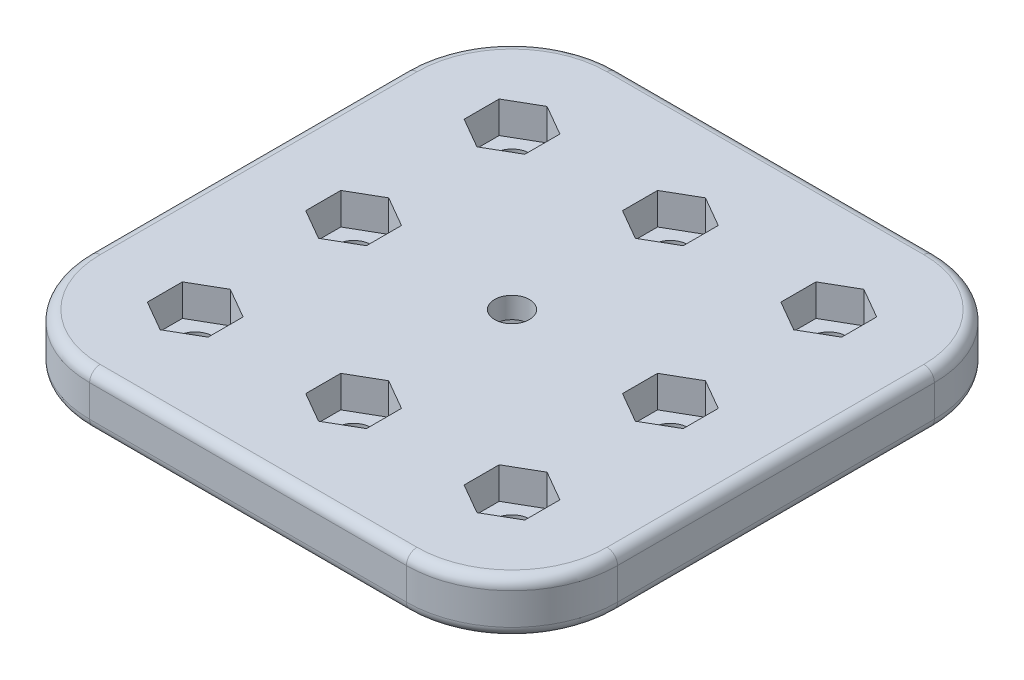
ISO-10303-21;
HEADER;
FILE_DESCRIPTION(('STEP AP214'),'2;1');
FILE_NAME('part.step','',(''),(''),'','','');
FILE_SCHEMA(('AUTOMOTIVE_DESIGN { 1 0 10303 214 1 1 1 1 }'));
ENDSEC;
DATA;
#1=APPLICATION_CONTEXT('core data for automotive mechanical design processes');
#2=APPLICATION_PROTOCOL_DEFINITION('international standard','automotive_design',2000,#1);
#3=PRODUCT_CONTEXT('',#1,'mechanical');
#4=PRODUCT('Part','Part','',(#3));
#5=PRODUCT_RELATED_PRODUCT_CATEGORY('part','',(#4));
#6=PRODUCT_DEFINITION_FORMATION('','',#4);
#7=PRODUCT_DEFINITION_CONTEXT('part definition',#1,'design');
#8=PRODUCT_DEFINITION('design','',#6,#7);
#9=PRODUCT_DEFINITION_SHAPE('','',#8);
#10=(LENGTH_UNIT() NAMED_UNIT(*) SI_UNIT(.MILLI.,.METRE.));
#11=(NAMED_UNIT(*) PLANE_ANGLE_UNIT() SI_UNIT($,.RADIAN.));
#12=(NAMED_UNIT(*) SI_UNIT($,.STERADIAN.) SOLID_ANGLE_UNIT());
#13=UNCERTAINTY_MEASURE_WITH_UNIT(LENGTH_MEASURE(1.E-05),#10,'distance_accuracy_value','');
#14=(GEOMETRIC_REPRESENTATION_CONTEXT(3) GLOBAL_UNCERTAINTY_ASSIGNED_CONTEXT((#13)) GLOBAL_UNIT_ASSIGNED_CONTEXT((#10,
#11,#12)) REPRESENTATION_CONTEXT('',''));
#15=CARTESIAN_POINT('',(0.,0.,0.));
#16=DIRECTION('',(0.,0.,1.));
#17=DIRECTION('',(1.,0.,0.));
#18=AXIS2_PLACEMENT_3D('',#15,#16,#17);
#19=CARTESIAN_POINT('',(-12.125,5.,0.));
#20=DIRECTION('',(-1.,0.,0.));
#21=DIRECTION('',(0.,0.,1.));
#22=AXIS2_PLACEMENT_3D('',#19,#20,#21);
#23=PLANE('',#22);
#24=DIRECTION('',(0.,-1.,0.));
#25=VECTOR('',#24,1.);
#26=CARTESIAN_POINT('',(-12.125,5.,-16.6598820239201));
#27=LINE('',#26,#25);
#28=CARTESIAN_POINT('',(-12.125,5.,-16.6598820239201));
#29=VERTEX_POINT('',#28);
#30=CARTESIAN_POINT('',(-12.125,2.,-16.6598820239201));
#31=VERTEX_POINT('',#30);
#32=EDGE_CURVE('E526',#29,#31,#27,.T.);
#33=ORIENTED_EDGE('',*,*,#32,.T.);
#34=DIRECTION('',(0.,0.,1.));
#35=VECTOR('',#34,1.);
#36=CARTESIAN_POINT('',(-12.1249999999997,2.,-16.6598820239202));
#37=LINE('',#36,#35);
#38=CARTESIAN_POINT('',(-12.1249999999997,2.,-13.3401179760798));
#39=VERTEX_POINT('',#38);
#40=EDGE_CURVE('E52',#31,#39,#37,.T.);
#41=ORIENTED_EDGE('',*,*,#40,.T.);
#42=DIRECTION('',(0.,-1.,0.));
#43=VECTOR('',#42,1.);
#44=CARTESIAN_POINT('',(-12.125,5.,-13.3401179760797));
#45=LINE('',#44,#43);
#46=CARTESIAN_POINT('',(-12.125,5.,-13.3401179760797));
#47=VERTEX_POINT('',#46);
#48=EDGE_CURVE('E498',#47,#39,#45,.T.);
#49=ORIENTED_EDGE('',*,*,#48,.F.);
#50=DIRECTION('',(0.,0.,-1.));
#51=VECTOR('',#50,1.);
#52=CARTESIAN_POINT('',(-12.125,5.,0.));
#53=LINE('',#52,#51);
#54=EDGE_CURVE('E2058',#47,#29,#53,.T.);
#55=ORIENTED_EDGE('',*,*,#54,.T.);
#56=EDGE_LOOP('',(#33,#41,#49,#55));
#57=FACE_BOUND('',#56,.T.);
#58=ADVANCED_FACE('F37',(#57),#23,.T.);
#59=CARTESIAN_POINT('',(-8.80769052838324,5.,-15.2553674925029));
#60=DIRECTION('',(-0.5,0.,-0.866025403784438));
#61=DIRECTION('',(-0.866025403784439,0.,0.5));
#62=AXIS2_PLACEMENT_3D('',#59,#60,#61);
#63=PLANE('',#62);
#64=ORIENTED_EDGE('',*,*,#48,.T.);
#65=DIRECTION('',(-0.866025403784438,0.,0.500000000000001));
#66=VECTOR('',#65,1.);
#67=CARTESIAN_POINT('',(-12.1249999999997,2.,-13.3401179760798));
#68=LINE('',#67,#66);
#69=CARTESIAN_POINT('',(-14.9999999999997,2.,-11.6802359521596));
#70=VERTEX_POINT('',#69);
#71=EDGE_CURVE('E2064',#39,#70,#68,.T.);
#72=ORIENTED_EDGE('',*,*,#71,.T.);
#73=DIRECTION('',(0.,-1.,0.));
#74=VECTOR('',#73,1.);
#75=CARTESIAN_POINT('',(-15.,5.,-11.6802359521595));
#76=LINE('',#75,#74);
#77=CARTESIAN_POINT('',(-15.,5.,-11.6802359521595));
#78=VERTEX_POINT('',#77);
#79=EDGE_CURVE('E489',#78,#70,#76,.T.);
#80=ORIENTED_EDGE('',*,*,#79,.F.);
#81=DIRECTION('',(0.866025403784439,0.,-0.5));
#82=VECTOR('',#81,1.);
#83=CARTESIAN_POINT('',(-8.80769052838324,5.,-15.2553674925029));
#84=LINE('',#83,#82);
#85=EDGE_CURVE('E2061',#78,#47,#84,.T.);
#86=ORIENTED_EDGE('',*,*,#85,.T.);
#87=EDGE_LOOP('',(#64,#72,#80,#86));
#88=FACE_BOUND('',#87,.T.);
#89=ADVANCED_FACE('F798',(#88),#63,.T.);
#90=CARTESIAN_POINT('',(1.30769052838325,5.,-2.26498643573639));
#91=DIRECTION('',(0.5,0.,-0.866025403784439));
#92=DIRECTION('',(-0.866025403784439,0.,-0.5));
#93=AXIS2_PLACEMENT_3D('',#90,#91,#92);
#94=PLANE('',#93);
#95=ORIENTED_EDGE('',*,*,#79,.T.);
#96=DIRECTION('',(-0.866025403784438,0.,-0.500000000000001));
#97=VECTOR('',#96,1.);
#98=CARTESIAN_POINT('',(-14.9999999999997,2.,-11.6802359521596));
#99=LINE('',#98,#97);
#100=CARTESIAN_POINT('',(-17.8749999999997,2.,-13.3401179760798));
#101=VERTEX_POINT('',#100);
#102=EDGE_CURVE('E475',#70,#101,#99,.T.);
#103=ORIENTED_EDGE('',*,*,#102,.T.);
#104=DIRECTION('',(0.,-1.,0.));
#105=VECTOR('',#104,1.);
#106=CARTESIAN_POINT('',(-17.875,5.,-13.3401179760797));
#107=LINE('',#106,#105);
#108=CARTESIAN_POINT('',(-17.875,5.,-13.3401179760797));
#109=VERTEX_POINT('',#108);
#110=EDGE_CURVE('E487',#109,#101,#107,.T.);
#111=ORIENTED_EDGE('',*,*,#110,.F.);
#112=DIRECTION('',(0.866025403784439,0.,0.5));
#113=VECTOR('',#112,1.);
#114=CARTESIAN_POINT('',(1.30769052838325,5.,-2.26498643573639));
#115=LINE('',#114,#113);
#116=EDGE_CURVE('E1884',#109,#78,#115,.T.);
#117=ORIENTED_EDGE('',*,*,#116,.T.);
#118=EDGE_LOOP('',(#95,#103,#111,#117));
#119=FACE_BOUND('',#118,.T.);
#120=ADVANCED_FACE('F485',(#119),#94,.T.);
#121=CARTESIAN_POINT('',(-17.875,5.,0.));
#122=DIRECTION('',(1.,0.,0.));
#123=DIRECTION('',(0.,0.,-1.));
#124=AXIS2_PLACEMENT_3D('',#121,#122,#123);
#125=PLANE('',#124);
#126=ORIENTED_EDGE('',*,*,#110,.T.);
#127=DIRECTION('',(0.,0.,-1.));
#128=VECTOR('',#127,1.);
#129=CARTESIAN_POINT('',(-17.8749999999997,2.,-13.3401179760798));
#130=LINE('',#129,#128);
#131=CARTESIAN_POINT('',(-17.8749999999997,2.,-16.6598820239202));
#132=VERTEX_POINT('',#131);
#133=EDGE_CURVE('E472',#101,#132,#130,.T.);
#134=ORIENTED_EDGE('',*,*,#133,.T.);
#135=DIRECTION('',(0.,-1.,0.));
#136=VECTOR('',#135,1.);
#137=CARTESIAN_POINT('',(-17.875,5.,-16.6598820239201));
#138=LINE('',#137,#136);
#139=CARTESIAN_POINT('',(-17.875,5.,-16.6598820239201));
#140=VERTEX_POINT('',#139);
#141=EDGE_CURVE('E496',#140,#132,#138,.T.);
#142=ORIENTED_EDGE('',*,*,#141,.F.);
#143=DIRECTION('',(0.,0.,1.));
#144=VECTOR('',#143,1.);
#145=CARTESIAN_POINT('',(-17.875,5.,0.));
#146=LINE('',#145,#144);
#147=EDGE_CURVE('E495',#140,#109,#146,.T.);
#148=ORIENTED_EDGE('',*,*,#147,.T.);
#149=EDGE_LOOP('',(#126,#134,#142,#148));
#150=FACE_BOUND('',#149,.T.);
#151=ADVANCED_FACE('F493',(#150),#125,.T.);
#152=CARTESIAN_POINT('',(-11.6826905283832,5.,-20.2350135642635));
#153=DIRECTION('',(0.5,0.,0.866025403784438));
#154=DIRECTION('',(0.866025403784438,0.,-0.5));
#155=AXIS2_PLACEMENT_3D('',#152,#153,#154);
#156=PLANE('',#155);
#157=ORIENTED_EDGE('',*,*,#141,.T.);
#158=DIRECTION('',(0.866025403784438,0.,-0.500000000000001));
#159=VECTOR('',#158,1.);
#160=CARTESIAN_POINT('',(-17.8749999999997,2.,-16.6598820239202));
#161=LINE('',#160,#159);
#162=CARTESIAN_POINT('',(-14.9999999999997,2.,-18.3197640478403));
#163=VERTEX_POINT('',#162);
#164=EDGE_CURVE('E478',#132,#163,#161,.T.);
#165=ORIENTED_EDGE('',*,*,#164,.T.);
#166=DIRECTION('',(0.,-1.,0.));
#167=VECTOR('',#166,1.);
#168=CARTESIAN_POINT('',(-15.,5.,-18.3197640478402));
#169=LINE('',#168,#167);
#170=CARTESIAN_POINT('',(-15.,5.,-18.3197640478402));
#171=VERTEX_POINT('',#170);
#172=EDGE_CURVE('E500',#171,#163,#169,.T.);
#173=ORIENTED_EDGE('',*,*,#172,.F.);
#174=DIRECTION('',(-0.866025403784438,0.,0.5));
#175=VECTOR('',#174,1.);
#176=CARTESIAN_POINT('',(-11.6826905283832,5.,-20.2350135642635));
#177=LINE('',#176,#175);
#178=EDGE_CURVE('E1877',#171,#140,#177,.T.);
#179=ORIENTED_EDGE('',*,*,#178,.T.);
#180=EDGE_LOOP('',(#157,#165,#173,#179));
#181=FACE_BOUND('',#180,.T.);
#182=ADVANCED_FACE('F1482',(#181),#156,.T.);
#183=CARTESIAN_POINT('',(4.18269052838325,5.,-7.24463250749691));
#184=DIRECTION('',(-0.5,0.,0.866025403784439));
#185=DIRECTION('',(0.866025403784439,0.,0.5));
#186=AXIS2_PLACEMENT_3D('',#183,#184,#185);
#187=PLANE('',#186);
#188=ORIENTED_EDGE('',*,*,#172,.T.);
#189=DIRECTION('',(0.866025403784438,0.,0.500000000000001));
#190=VECTOR('',#189,1.);
#191=CARTESIAN_POINT('',(-14.9999999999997,2.,-18.3197640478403));
#192=LINE('',#191,#190);
#193=EDGE_CURVE('E1872',#163,#31,#192,.T.);
#194=ORIENTED_EDGE('',*,*,#193,.T.);
#195=ORIENTED_EDGE('',*,*,#32,.F.);
#196=DIRECTION('',(-0.866025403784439,0.,-0.5));
#197=VECTOR('',#196,1.);
#198=CARTESIAN_POINT('',(4.18269052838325,5.,-7.24463250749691));
#199=LINE('',#198,#197);
#200=EDGE_CURVE('E1874',#29,#171,#199,.T.);
#201=ORIENTED_EDGE('',*,*,#200,.T.);
#202=EDGE_LOOP('',(#188,#194,#195,#201));
#203=FACE_BOUND('',#202,.T.);
#204=ADVANCED_FACE('F833',(#203),#187,.T.);
#205=CARTESIAN_POINT('',(-12.1249999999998,5.,0.));
#206=DIRECTION('',(-1.,0.,0.));
#207=DIRECTION('',(0.,0.,1.));
#208=AXIS2_PLACEMENT_3D('',#205,#206,#207);
#209=PLANE('',#208);
#210=DIRECTION('',(0.,-1.,0.));
#211=VECTOR('',#210,1.);
#212=CARTESIAN_POINT('',(-12.1249999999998,5.,-1.65988202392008));
#213=LINE('',#212,#211);
#214=CARTESIAN_POINT('',(-12.1249999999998,5.,-1.65988202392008));
#215=VERTEX_POINT('',#214);
#216=CARTESIAN_POINT('',(-12.1249999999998,2.,-1.65988202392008));
#217=VERTEX_POINT('',#216);
#218=EDGE_CURVE('E507',#215,#217,#213,.T.);
#219=ORIENTED_EDGE('',*,*,#218,.T.);
#220=DIRECTION('',(0.,0.,1.));
#221=VECTOR('',#220,1.);
#222=CARTESIAN_POINT('',(-12.1249999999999,2.,-1.65988202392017));
#223=LINE('',#222,#221);
#224=CARTESIAN_POINT('',(-12.1249999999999,2.,1.65988202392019));
#225=VERTEX_POINT('',#224);
#226=EDGE_CURVE('E60',#217,#225,#223,.T.);
#227=ORIENTED_EDGE('',*,*,#226,.T.);
#228=DIRECTION('',(0.,-1.,0.));
#229=VECTOR('',#228,1.);
#230=CARTESIAN_POINT('',(-12.1249999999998,5.,1.65988202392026));
#231=LINE('',#230,#229);
#232=CARTESIAN_POINT('',(-12.1249999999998,5.,1.65988202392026));
#233=VERTEX_POINT('',#232);
#234=EDGE_CURVE('E523',#233,#225,#231,.T.);
#235=ORIENTED_EDGE('',*,*,#234,.F.);
#236=DIRECTION('',(0.,0.,-1.));
#237=VECTOR('',#236,1.);
#238=CARTESIAN_POINT('',(-12.1249999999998,5.,0.));
#239=LINE('',#238,#237);
#240=EDGE_CURVE('E2040',#233,#215,#239,.T.);
#241=ORIENTED_EDGE('',*,*,#240,.T.);
#242=EDGE_LOOP('',(#219,#227,#235,#241));
#243=FACE_BOUND('',#242,.T.);
#244=ADVANCED_FACE('F829',(#243),#209,.T.);
#245=CARTESIAN_POINT('',(-2.31249999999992,5.,-4.00536749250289));
#246=DIRECTION('',(-0.5,0.,-0.866025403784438));
#247=DIRECTION('',(-0.866025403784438,0.,0.5));
#248=AXIS2_PLACEMENT_3D('',#245,#246,#247);
#249=PLANE('',#248);
#250=ORIENTED_EDGE('',*,*,#234,.T.);
#251=DIRECTION('',(-0.866025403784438,0.,0.500000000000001));
#252=VECTOR('',#251,1.);
#253=CARTESIAN_POINT('',(-12.1249999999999,2.,1.65988202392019));
#254=LINE('',#253,#252);
#255=CARTESIAN_POINT('',(-14.9999999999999,2.,3.31976404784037));
#256=VERTEX_POINT('',#255);
#257=EDGE_CURVE('E2087',#225,#256,#254,.T.);
#258=ORIENTED_EDGE('',*,*,#257,.T.);
#259=DIRECTION('',(0.,-1.,0.));
#260=VECTOR('',#259,1.);
#261=CARTESIAN_POINT('',(-14.9999999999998,5.,3.31976404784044));
#262=LINE('',#261,#260);
#263=CARTESIAN_POINT('',(-14.9999999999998,5.,3.31976404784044));
#264=VERTEX_POINT('',#263);
#265=EDGE_CURVE('E520',#264,#256,#262,.T.);
#266=ORIENTED_EDGE('',*,*,#265,.F.);
#267=DIRECTION('',(0.866025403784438,0.,-0.5));
#268=VECTOR('',#267,1.);
#269=CARTESIAN_POINT('',(-2.31249999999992,5.,-4.00536749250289));
#270=LINE('',#269,#268);
#271=EDGE_CURVE('E2043',#264,#233,#270,.T.);
#272=ORIENTED_EDGE('',*,*,#271,.T.);
#273=EDGE_LOOP('',(#250,#258,#266,#272));
#274=FACE_BOUND('',#273,.T.);
#275=ADVANCED_FACE('F825',(#274),#249,.T.);
#276=CARTESIAN_POINT('',(-5.18749999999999,5.,8.98501356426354));
#277=DIRECTION('',(0.5,0.,-0.866025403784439));
#278=DIRECTION('',(-0.866025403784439,0.,-0.5));
#279=AXIS2_PLACEMENT_3D('',#276,#277,#278);
#280=PLANE('',#279);
#281=ORIENTED_EDGE('',*,*,#265,.T.);
#282=DIRECTION('',(-0.866025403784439,0.,-0.5));
#283=VECTOR('',#282,1.);
#284=CARTESIAN_POINT('',(-14.9999999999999,2.,3.31976404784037));
#285=LINE('',#284,#283);
#286=CARTESIAN_POINT('',(-17.8749999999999,2.,1.65988202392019));
#287=VERTEX_POINT('',#286);
#288=EDGE_CURVE('E2074',#256,#287,#285,.T.);
#289=ORIENTED_EDGE('',*,*,#288,.T.);
#290=DIRECTION('',(0.,-1.,0.));
#291=VECTOR('',#290,1.);
#292=CARTESIAN_POINT('',(-17.8749999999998,5.,1.65988202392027));
#293=LINE('',#292,#291);
#294=CARTESIAN_POINT('',(-17.8749999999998,5.,1.65988202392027));
#295=VERTEX_POINT('',#294);
#296=EDGE_CURVE('E517',#295,#287,#293,.T.);
#297=ORIENTED_EDGE('',*,*,#296,.F.);
#298=DIRECTION('',(0.866025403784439,0.,0.5));
#299=VECTOR('',#298,1.);
#300=CARTESIAN_POINT('',(-5.18749999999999,5.,8.98501356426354));
#301=LINE('',#300,#299);
#302=EDGE_CURVE('E2046',#295,#264,#301,.T.);
#303=ORIENTED_EDGE('',*,*,#302,.T.);
#304=EDGE_LOOP('',(#281,#289,#297,#303));
#305=FACE_BOUND('',#304,.T.);
#306=ADVANCED_FACE('F821',(#305),#280,.T.);
#307=CARTESIAN_POINT('',(-17.8749999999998,5.,0.));
#308=DIRECTION('',(1.,0.,0.));
#309=DIRECTION('',(0.,0.,-1.));
#310=AXIS2_PLACEMENT_3D('',#307,#308,#309);
#311=PLANE('',#310);
#312=ORIENTED_EDGE('',*,*,#296,.T.);
#313=DIRECTION('',(0.,0.,-1.));
#314=VECTOR('',#313,1.);
#315=CARTESIAN_POINT('',(-17.8749999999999,2.,1.65988202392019));
#316=LINE('',#315,#314);
#317=CARTESIAN_POINT('',(-17.8749999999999,2.,-1.65988202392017));
#318=VERTEX_POINT('',#317);
#319=EDGE_CURVE('E2078',#287,#318,#316,.T.);
#320=ORIENTED_EDGE('',*,*,#319,.T.);
#321=DIRECTION('',(0.,-1.,0.));
#322=VECTOR('',#321,1.);
#323=CARTESIAN_POINT('',(-17.8749999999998,5.,-1.65988202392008));
#324=LINE('',#323,#322);
#325=CARTESIAN_POINT('',(-17.8749999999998,5.,-1.65988202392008));
#326=VERTEX_POINT('',#325);
#327=EDGE_CURVE('E514',#326,#318,#324,.T.);
#328=ORIENTED_EDGE('',*,*,#327,.F.);
#329=DIRECTION('',(0.,0.,1.));
#330=VECTOR('',#329,1.);
#331=CARTESIAN_POINT('',(-17.8749999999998,5.,0.));
#332=LINE('',#331,#330);
#333=EDGE_CURVE('E2049',#326,#295,#332,.T.);
#334=ORIENTED_EDGE('',*,*,#333,.T.);
#335=EDGE_LOOP('',(#312,#320,#328,#334));
#336=FACE_BOUND('',#335,.T.);
#337=ADVANCED_FACE('F817',(#336),#311,.T.);
#338=CARTESIAN_POINT('',(-5.18749999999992,5.,-8.9850135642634));
#339=DIRECTION('',(0.500000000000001,0.,0.866025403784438));
#340=DIRECTION('',(0.866025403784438,0.,-0.500000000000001));
#341=AXIS2_PLACEMENT_3D('',#338,#339,#340);
#342=PLANE('',#341);
#343=ORIENTED_EDGE('',*,*,#327,.T.);
#344=DIRECTION('',(0.866025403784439,0.,-0.5));
#345=VECTOR('',#344,1.);
#346=CARTESIAN_POINT('',(-17.8749999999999,2.,-1.65988202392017));
#347=LINE('',#346,#345);
#348=CARTESIAN_POINT('',(-14.9999999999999,2.,-3.31976404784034));
#349=VERTEX_POINT('',#348);
#350=EDGE_CURVE('E2081',#318,#349,#347,.T.);
#351=ORIENTED_EDGE('',*,*,#350,.T.);
#352=DIRECTION('',(0.,-1.,0.));
#353=VECTOR('',#352,1.);
#354=CARTESIAN_POINT('',(-14.9999999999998,5.,-3.31976404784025));
#355=LINE('',#354,#353);
#356=CARTESIAN_POINT('',(-14.9999999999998,5.,-3.31976404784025));
#357=VERTEX_POINT('',#356);
#358=EDGE_CURVE('E510',#357,#349,#355,.T.);
#359=ORIENTED_EDGE('',*,*,#358,.F.);
#360=DIRECTION('',(-0.866025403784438,0.,0.500000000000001));
#361=VECTOR('',#360,1.);
#362=CARTESIAN_POINT('',(-5.18749999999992,5.,-8.9850135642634));
#363=LINE('',#362,#361);
#364=EDGE_CURVE('E2052',#357,#326,#363,.T.);
#365=ORIENTED_EDGE('',*,*,#364,.T.);
#366=EDGE_LOOP('',(#343,#351,#359,#365));
#367=FACE_BOUND('',#366,.T.);
#368=ADVANCED_FACE('F813',(#367),#342,.T.);
#369=CARTESIAN_POINT('',(-2.31249999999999,5.,4.00536749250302));
#370=DIRECTION('',(-0.5,0.,0.866025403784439));
#371=DIRECTION('',(0.866025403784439,0.,0.5));
#372=AXIS2_PLACEMENT_3D('',#369,#370,#371);
#373=PLANE('',#372);
#374=ORIENTED_EDGE('',*,*,#358,.T.);
#375=DIRECTION('',(0.866025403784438,0.,0.5));
#376=VECTOR('',#375,1.);
#377=CARTESIAN_POINT('',(-14.9999999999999,2.,-3.31976404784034));
#378=LINE('',#377,#376);
#379=EDGE_CURVE('E2084',#349,#217,#378,.T.);
#380=ORIENTED_EDGE('',*,*,#379,.T.);
#381=ORIENTED_EDGE('',*,*,#218,.F.);
#382=DIRECTION('',(-0.866025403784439,0.,-0.5));
#383=VECTOR('',#382,1.);
#384=CARTESIAN_POINT('',(-2.31249999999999,5.,4.00536749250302));
#385=LINE('',#384,#383);
#386=EDGE_CURVE('E2055',#215,#357,#385,.T.);
#387=ORIENTED_EDGE('',*,*,#386,.T.);
#388=EDGE_LOOP('',(#374,#380,#381,#387));
#389=FACE_BOUND('',#388,.T.);
#390=ADVANCED_FACE('F809',(#389),#373,.T.);
#391=CARTESIAN_POINT('',(17.875,5.,0.));
#392=DIRECTION('',(-1.,0.,0.));
#393=DIRECTION('',(0.,0.,1.));
#394=AXIS2_PLACEMENT_3D('',#391,#392,#393);
#395=PLANE('',#394);
#396=DIRECTION('',(0.,-1.,0.));
#397=VECTOR('',#396,1.);
#398=CARTESIAN_POINT('',(17.875,5.,-16.6598820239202));
#399=LINE('',#398,#397);
#400=CARTESIAN_POINT('',(17.875,5.,-16.6598820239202));
#401=VERTEX_POINT('',#400);
#402=CARTESIAN_POINT('',(17.875,2.,-16.6598820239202));
#403=VERTEX_POINT('',#402);
#404=EDGE_CURVE('E1800',#401,#403,#399,.T.);
#405=ORIENTED_EDGE('',*,*,#404,.T.);
#406=DIRECTION('',(0.,0.,1.));
#407=VECTOR('',#406,1.);
#408=CARTESIAN_POINT('',(17.8750000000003,2.,-16.6598820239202));
#409=LINE('',#408,#407);
#410=CARTESIAN_POINT('',(17.8750000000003,2.,-13.3401179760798));
#411=VERTEX_POINT('',#410);
#412=EDGE_CURVE('E2108',#403,#411,#409,.T.);
#413=ORIENTED_EDGE('',*,*,#412,.T.);
#414=DIRECTION('',(0.,-1.,0.));
#415=VECTOR('',#414,1.);
#416=CARTESIAN_POINT('',(17.875,5.,-13.3401179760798));
#417=LINE('',#416,#415);
#418=CARTESIAN_POINT('',(17.875,5.,-13.3401179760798));
#419=VERTEX_POINT('',#418);
#420=EDGE_CURVE('E1784',#419,#411,#417,.T.);
#421=ORIENTED_EDGE('',*,*,#420,.F.);
#422=DIRECTION('',(0.,0.,-1.));
#423=VECTOR('',#422,1.);
#424=CARTESIAN_POINT('',(17.875,5.,0.));
#425=LINE('',#424,#423);
#426=EDGE_CURVE('E1941',#419,#401,#425,.T.);
#427=ORIENTED_EDGE('',*,*,#426,.T.);
#428=EDGE_LOOP('',(#405,#413,#421,#427));
#429=FACE_BOUND('',#428,.T.);
#430=ADVANCED_FACE('F812',(#429),#395,.T.);
#431=CARTESIAN_POINT('',(-1.30769052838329,5.,-2.26498643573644));
#432=DIRECTION('',(-0.500000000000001,0.,-0.866025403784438));
#433=DIRECTION('',(-0.866025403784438,0.,0.500000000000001));
#434=AXIS2_PLACEMENT_3D('',#431,#432,#433);
#435=PLANE('',#434);
#436=ORIENTED_EDGE('',*,*,#420,.T.);
#437=DIRECTION('',(-0.866025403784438,0.,0.500000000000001));
#438=VECTOR('',#437,1.);
#439=CARTESIAN_POINT('',(17.8750000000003,2.,-13.3401179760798));
#440=LINE('',#439,#438);
#441=CARTESIAN_POINT('',(15.0000000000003,2.,-11.6802359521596));
#442=VERTEX_POINT('',#441);
#443=EDGE_CURVE('E2111',#411,#442,#440,.T.);
#444=ORIENTED_EDGE('',*,*,#443,.T.);
#445=DIRECTION('',(0.,-1.,0.));
#446=VECTOR('',#445,1.);
#447=CARTESIAN_POINT('',(15.,5.,-11.6802359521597));
#448=LINE('',#447,#446);
#449=CARTESIAN_POINT('',(15.,5.,-11.6802359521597));
#450=VERTEX_POINT('',#449);
#451=EDGE_CURVE('E1813',#450,#442,#448,.T.);
#452=ORIENTED_EDGE('',*,*,#451,.F.);
#453=DIRECTION('',(0.866025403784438,0.,-0.500000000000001));
#454=VECTOR('',#453,1.);
#455=CARTESIAN_POINT('',(-1.30769052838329,5.,-2.26498643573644));
#456=LINE('',#455,#454);
#457=EDGE_CURVE('E1944',#450,#419,#456,.T.);
#458=ORIENTED_EDGE('',*,*,#457,.T.);
#459=EDGE_LOOP('',(#436,#444,#452,#458));
#460=FACE_BOUND('',#459,.T.);
#461=ADVANCED_FACE('F1418',(#460),#435,.T.);
#462=CARTESIAN_POINT('',(8.80769052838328,5.,-15.255367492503));
#463=DIRECTION('',(0.5,0.,-0.866025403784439));
#464=DIRECTION('',(-0.866025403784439,0.,-0.5));
#465=AXIS2_PLACEMENT_3D('',#462,#463,#464);
#466=PLANE('',#465);
#467=ORIENTED_EDGE('',*,*,#451,.T.);
#468=DIRECTION('',(-0.866025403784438,0.,-0.5));
#469=VECTOR('',#468,1.);
#470=CARTESIAN_POINT('',(15.0000000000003,2.,-11.6802359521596));
#471=LINE('',#470,#469);
#472=CARTESIAN_POINT('',(12.1250000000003,2.,-13.3401179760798));
#473=VERTEX_POINT('',#472);
#474=EDGE_CURVE('E2094',#442,#473,#471,.T.);
#475=ORIENTED_EDGE('',*,*,#474,.T.);
#476=DIRECTION('',(0.,-1.,0.));
#477=VECTOR('',#476,1.);
#478=CARTESIAN_POINT('',(12.125,5.,-13.3401179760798));
#479=LINE('',#478,#477);
#480=CARTESIAN_POINT('',(12.125,5.,-13.3401179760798));
#481=VERTEX_POINT('',#480);
#482=EDGE_CURVE('E1810',#481,#473,#479,.T.);
#483=ORIENTED_EDGE('',*,*,#482,.F.);
#484=DIRECTION('',(0.866025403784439,0.,0.5));
#485=VECTOR('',#484,1.);
#486=CARTESIAN_POINT('',(8.80769052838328,5.,-15.255367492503));
#487=LINE('',#486,#485);
#488=EDGE_CURVE('E1947',#481,#450,#487,.T.);
#489=ORIENTED_EDGE('',*,*,#488,.T.);
#490=EDGE_LOOP('',(#467,#475,#483,#489));
#491=FACE_BOUND('',#490,.T.);
#492=ADVANCED_FACE('F1408',(#491),#466,.T.);
#493=CARTESIAN_POINT('',(12.125,5.,0.));
#494=DIRECTION('',(1.,0.,0.));
#495=DIRECTION('',(0.,0.,-1.));
#496=AXIS2_PLACEMENT_3D('',#493,#494,#495);
#497=PLANE('',#496);
#498=ORIENTED_EDGE('',*,*,#482,.T.);
#499=DIRECTION('',(0.,0.,-1.));
#500=VECTOR('',#499,1.);
#501=CARTESIAN_POINT('',(12.1250000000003,2.,-13.3401179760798));
#502=LINE('',#501,#500);
#503=CARTESIAN_POINT('',(12.1250000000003,2.,-16.6598820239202));
#504=VERTEX_POINT('',#503);
#505=EDGE_CURVE('E2099',#473,#504,#502,.T.);
#506=ORIENTED_EDGE('',*,*,#505,.T.);
#507=DIRECTION('',(0.,-1.,0.));
#508=VECTOR('',#507,1.);
#509=CARTESIAN_POINT('',(12.125,5.,-16.6598820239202));
#510=LINE('',#509,#508);
#511=CARTESIAN_POINT('',(12.125,5.,-16.6598820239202));
#512=VERTEX_POINT('',#511);
#513=EDGE_CURVE('E1807',#512,#504,#510,.T.);
#514=ORIENTED_EDGE('',*,*,#513,.F.);
#515=DIRECTION('',(0.,0.,1.));
#516=VECTOR('',#515,1.);
#517=CARTESIAN_POINT('',(12.125,5.,0.));
#518=LINE('',#517,#516);
#519=EDGE_CURVE('E1950',#512,#481,#518,.T.);
#520=ORIENTED_EDGE('',*,*,#519,.T.);
#521=EDGE_LOOP('',(#498,#506,#514,#520));
#522=FACE_BOUND('',#521,.T.);
#523=ADVANCED_FACE('F1398',(#522),#497,.T.);
#524=CARTESIAN_POINT('',(-4.18269052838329,5.,-7.24463250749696));
#525=DIRECTION('',(0.500000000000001,0.,0.866025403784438));
#526=DIRECTION('',(0.866025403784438,0.,-0.500000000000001));
#527=AXIS2_PLACEMENT_3D('',#524,#525,#526);
#528=PLANE('',#527);
#529=ORIENTED_EDGE('',*,*,#513,.T.);
#530=DIRECTION('',(0.866025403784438,0.,-0.5));
#531=VECTOR('',#530,1.);
#532=CARTESIAN_POINT('',(12.1250000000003,2.,-16.6598820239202));
#533=LINE('',#532,#531);
#534=CARTESIAN_POINT('',(15.0000000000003,2.,-18.3197640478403));
#535=VERTEX_POINT('',#534);
#536=EDGE_CURVE('E2102',#504,#535,#533,.T.);
#537=ORIENTED_EDGE('',*,*,#536,.T.);
#538=DIRECTION('',(0.,-1.,0.));
#539=VECTOR('',#538,1.);
#540=CARTESIAN_POINT('',(15.,5.,-18.3197640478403));
#541=LINE('',#540,#539);
#542=CARTESIAN_POINT('',(15.,5.,-18.3197640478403));
#543=VERTEX_POINT('',#542);
#544=EDGE_CURVE('E1803',#543,#535,#541,.T.);
#545=ORIENTED_EDGE('',*,*,#544,.F.);
#546=DIRECTION('',(-0.866025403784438,0.,0.500000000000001));
#547=VECTOR('',#546,1.);
#548=CARTESIAN_POINT('',(-4.18269052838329,5.,-7.24463250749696));
#549=LINE('',#548,#547);
#550=EDGE_CURVE('E1953',#543,#512,#549,.T.);
#551=ORIENTED_EDGE('',*,*,#550,.T.);
#552=EDGE_LOOP('',(#529,#537,#545,#551));
#553=FACE_BOUND('',#552,.T.);
#554=ADVANCED_FACE('F1388',(#553),#528,.T.);
#555=CARTESIAN_POINT('',(11.6826905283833,5.,-20.2350135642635));
#556=DIRECTION('',(-0.5,0.,0.866025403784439));
#557=DIRECTION('',(0.866025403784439,0.,0.5));
#558=AXIS2_PLACEMENT_3D('',#555,#556,#557);
#559=PLANE('',#558);
#560=ORIENTED_EDGE('',*,*,#544,.T.);
#561=DIRECTION('',(0.866025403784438,0.,0.500000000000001));
#562=VECTOR('',#561,1.);
#563=CARTESIAN_POINT('',(15.0000000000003,2.,-18.3197640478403));
#564=LINE('',#563,#562);
#565=EDGE_CURVE('E2105',#535,#403,#564,.T.);
#566=ORIENTED_EDGE('',*,*,#565,.T.);
#567=ORIENTED_EDGE('',*,*,#404,.F.);
#568=DIRECTION('',(-0.866025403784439,0.,-0.5));
#569=VECTOR('',#568,1.);
#570=CARTESIAN_POINT('',(11.6826905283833,5.,-20.2350135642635));
#571=LINE('',#570,#569);
#572=EDGE_CURVE('E1956',#401,#543,#571,.T.);
#573=ORIENTED_EDGE('',*,*,#572,.T.);
#574=EDGE_LOOP('',(#560,#566,#567,#573));
#575=FACE_BOUND('',#574,.T.);
#576=ADVANCED_FACE('F1378',(#575),#559,.T.);
#577=CARTESIAN_POINT('',(5.05769052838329,5.,-8.76017696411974));
#578=DIRECTION('',(0.5,0.,-0.866025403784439));
#579=DIRECTION('',(-0.866025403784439,0.,-0.5));
#580=AXIS2_PLACEMENT_3D('',#577,#578,#579);
#581=PLANE('',#580);
#582=DIRECTION('',(0.,-1.,0.));
#583=VECTOR('',#582,1.);
#584=CARTESIAN_POINT('',(0.,5.,-11.6802359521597));
#585=LINE('',#584,#583);
#586=CARTESIAN_POINT('',(0.,5.,-11.6802359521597));
#587=VERTEX_POINT('',#586);
#588=CARTESIAN_POINT('',(0.,2.,-11.6802359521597));
#589=VERTEX_POINT('',#588);
#590=EDGE_CURVE('E1780',#587,#589,#585,.T.);
#591=ORIENTED_EDGE('',*,*,#590,.T.);
#592=DIRECTION('',(-0.866025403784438,0.,-0.5));
#593=VECTOR('',#592,1.);
#594=CARTESIAN_POINT('',(2.96637714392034E-13,2.,-11.6802359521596));
#595=LINE('',#594,#593);
#596=CARTESIAN_POINT('',(-2.8749999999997,2.,-13.3401179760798));
#597=VERTEX_POINT('',#596);
#598=EDGE_CURVE('E2118',#589,#597,#595,.T.);
#599=ORIENTED_EDGE('',*,*,#598,.T.);
#600=DIRECTION('',(0.,-1.,0.));
#601=VECTOR('',#600,1.);
#602=CARTESIAN_POINT('',(-2.87500000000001,5.,-13.3401179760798));
#603=LINE('',#602,#601);
#604=CARTESIAN_POINT('',(-2.87500000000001,5.,-13.3401179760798));
#605=VERTEX_POINT('',#604);
#606=EDGE_CURVE('E1796',#605,#597,#603,.T.);
#607=ORIENTED_EDGE('',*,*,#606,.F.);
#608=DIRECTION('',(0.866025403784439,0.,0.5));
#609=VECTOR('',#608,1.);
#610=CARTESIAN_POINT('',(5.05769052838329,5.,-8.76017696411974));
#611=LINE('',#610,#609);
#612=EDGE_CURVE('E1959',#605,#587,#611,.T.);
#613=ORIENTED_EDGE('',*,*,#612,.T.);
#614=EDGE_LOOP('',(#591,#599,#607,#613));
#615=FACE_BOUND('',#614,.T.);
#616=ADVANCED_FACE('F1368',(#615),#581,.T.);
#617=CARTESIAN_POINT('',(-2.87500000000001,5.,0.));
#618=DIRECTION('',(1.,0.,0.));
#619=DIRECTION('',(0.,0.,-1.));
#620=AXIS2_PLACEMENT_3D('',#617,#618,#619);
#621=PLANE('',#620);
#622=ORIENTED_EDGE('',*,*,#606,.T.);
#623=DIRECTION('',(0.,0.,-1.));
#624=VECTOR('',#623,1.);
#625=CARTESIAN_POINT('',(-2.8749999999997,2.,-13.3401179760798));
#626=LINE('',#625,#624);
#627=CARTESIAN_POINT('',(-2.8749999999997,2.,-16.6598820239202));
#628=VERTEX_POINT('',#627);
#629=EDGE_CURVE('E2123',#597,#628,#626,.T.);
#630=ORIENTED_EDGE('',*,*,#629,.T.);
#631=DIRECTION('',(0.,-1.,0.));
#632=VECTOR('',#631,1.);
#633=CARTESIAN_POINT('',(-2.87500000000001,5.,-16.6598820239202));
#634=LINE('',#633,#632);
#635=CARTESIAN_POINT('',(-2.87500000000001,5.,-16.6598820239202));
#636=VERTEX_POINT('',#635);
#637=EDGE_CURVE('E1793',#636,#628,#634,.T.);
#638=ORIENTED_EDGE('',*,*,#637,.F.);
#639=DIRECTION('',(0.,0.,1.));
#640=VECTOR('',#639,1.);
#641=CARTESIAN_POINT('',(-2.87500000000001,5.,0.));
#642=LINE('',#641,#640);
#643=EDGE_CURVE('E1962',#636,#605,#642,.T.);
#644=ORIENTED_EDGE('',*,*,#643,.T.);
#645=EDGE_LOOP('',(#622,#630,#638,#644));
#646=FACE_BOUND('',#645,.T.);
#647=ADVANCED_FACE('F1358',(#646),#621,.T.);
#648=CARTESIAN_POINT('',(-7.9326905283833,5.,-13.7398230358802));
#649=DIRECTION('',(0.500000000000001,0.,0.866025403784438));
#650=DIRECTION('',(0.866025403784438,0.,-0.500000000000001));
#651=AXIS2_PLACEMENT_3D('',#648,#649,#650);
#652=PLANE('',#651);
#653=ORIENTED_EDGE('',*,*,#637,.T.);
#654=DIRECTION('',(0.866025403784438,0.,-0.5));
#655=VECTOR('',#654,1.);
#656=CARTESIAN_POINT('',(-2.8749999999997,2.,-16.6598820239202));
#657=LINE('',#656,#655);
#658=CARTESIAN_POINT('',(2.96637714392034E-13,2.,-18.3197640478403));
#659=VERTEX_POINT('',#658);
#660=EDGE_CURVE('E2126',#628,#659,#657,.T.);
#661=ORIENTED_EDGE('',*,*,#660,.T.);
#662=DIRECTION('',(0.,-1.,0.));
#663=VECTOR('',#662,1.);
#664=CARTESIAN_POINT('',(0.,5.,-18.3197640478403));
#665=LINE('',#664,#663);
#666=CARTESIAN_POINT('',(0.,5.,-18.3197640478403));
#667=VERTEX_POINT('',#666);
#668=EDGE_CURVE('E1790',#667,#659,#665,.T.);
#669=ORIENTED_EDGE('',*,*,#668,.F.);
#670=DIRECTION('',(-0.866025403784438,0.,0.500000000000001));
#671=VECTOR('',#670,1.);
#672=CARTESIAN_POINT('',(-7.9326905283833,5.,-13.7398230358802));
#673=LINE('',#672,#671);
#674=EDGE_CURVE('E1965',#667,#636,#673,.T.);
#675=ORIENTED_EDGE('',*,*,#674,.T.);
#676=EDGE_LOOP('',(#653,#661,#669,#675));
#677=FACE_BOUND('',#676,.T.);
#678=ADVANCED_FACE('F1348',(#677),#652,.T.);
#679=CARTESIAN_POINT('',(7.93269052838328,5.,-13.7398230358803));
#680=DIRECTION('',(-0.5,0.,0.866025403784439));
#681=DIRECTION('',(0.866025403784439,0.,0.5));
#682=AXIS2_PLACEMENT_3D('',#679,#680,#681);
#683=PLANE('',#682);
#684=ORIENTED_EDGE('',*,*,#668,.T.);
#685=DIRECTION('',(0.866025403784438,0.,0.500000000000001));
#686=VECTOR('',#685,1.);
#687=CARTESIAN_POINT('',(2.96637714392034E-13,2.,-18.3197640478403));
#688=LINE('',#687,#686);
#689=CARTESIAN_POINT('',(2.8750000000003,2.,-16.6598820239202));
#690=VERTEX_POINT('',#689);
#691=EDGE_CURVE('E2129',#659,#690,#688,.T.);
#692=ORIENTED_EDGE('',*,*,#691,.T.);
#693=DIRECTION('',(0.,-1.,0.));
#694=VECTOR('',#693,1.);
#695=CARTESIAN_POINT('',(2.87499999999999,5.,-16.6598820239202));
#696=LINE('',#695,#694);
#697=CARTESIAN_POINT('',(2.87499999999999,5.,-16.6598820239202));
#698=VERTEX_POINT('',#697);
#699=EDGE_CURVE('E1787',#698,#690,#696,.T.);
#700=ORIENTED_EDGE('',*,*,#699,.F.);
#701=DIRECTION('',(-0.866025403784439,0.,-0.5));
#702=VECTOR('',#701,1.);
#703=CARTESIAN_POINT('',(7.93269052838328,5.,-13.7398230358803));
#704=LINE('',#703,#702);
#705=EDGE_CURVE('E1968',#698,#667,#704,.T.);
#706=ORIENTED_EDGE('',*,*,#705,.T.);
#707=EDGE_LOOP('',(#684,#692,#700,#706));
#708=FACE_BOUND('',#707,.T.);
#709=ADVANCED_FACE('F1338',(#708),#683,.T.);
#710=CARTESIAN_POINT('',(2.87499999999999,5.,0.));
#711=DIRECTION('',(-1.,0.,0.));
#712=DIRECTION('',(0.,0.,1.));
#713=AXIS2_PLACEMENT_3D('',#710,#711,#712);
#714=PLANE('',#713);
#715=ORIENTED_EDGE('',*,*,#699,.T.);
#716=DIRECTION('',(0.,0.,1.));
#717=VECTOR('',#716,1.);
#718=CARTESIAN_POINT('',(2.8750000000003,2.,-16.6598820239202));
#719=LINE('',#718,#717);
#720=CARTESIAN_POINT('',(2.8750000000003,2.,-13.3401179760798));
#721=VERTEX_POINT('',#720);
#722=EDGE_CURVE('E2132',#690,#721,#719,.T.);
#723=ORIENTED_EDGE('',*,*,#722,.T.);
#724=DIRECTION('',(0.,-1.,0.));
#725=VECTOR('',#724,1.);
#726=CARTESIAN_POINT('',(2.87499999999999,5.,-13.3401179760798));
#727=LINE('',#726,#725);
#728=CARTESIAN_POINT('',(2.87499999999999,5.,-13.3401179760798));
#729=VERTEX_POINT('',#728);
#730=EDGE_CURVE('E1783',#729,#721,#727,.T.);
#731=ORIENTED_EDGE('',*,*,#730,.F.);
#732=DIRECTION('',(0.,0.,-1.));
#733=VECTOR('',#732,1.);
#734=CARTESIAN_POINT('',(2.87499999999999,5.,0.));
#735=LINE('',#734,#733);
#736=EDGE_CURVE('E1971',#729,#698,#735,.T.);
#737=ORIENTED_EDGE('',*,*,#736,.T.);
#738=EDGE_LOOP('',(#715,#723,#731,#737));
#739=FACE_BOUND('',#738,.T.);
#740=ADVANCED_FACE('F1328',(#739),#714,.T.);
#741=CARTESIAN_POINT('',(-5.05769052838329,5.,-8.76017696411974));
#742=DIRECTION('',(-0.5,0.,-0.866025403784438));
#743=DIRECTION('',(-0.866025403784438,0.,0.5));
#744=AXIS2_PLACEMENT_3D('',#741,#742,#743);
#745=PLANE('',#744);
#746=ORIENTED_EDGE('',*,*,#730,.T.);
#747=DIRECTION('',(-0.866025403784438,0.,0.500000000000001));
#748=VECTOR('',#747,1.);
#749=CARTESIAN_POINT('',(2.8750000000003,2.,-13.3401179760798));
#750=LINE('',#749,#748);
#751=EDGE_CURVE('E2135',#721,#589,#750,.T.);
#752=ORIENTED_EDGE('',*,*,#751,.T.);
#753=ORIENTED_EDGE('',*,*,#590,.F.);
#754=DIRECTION('',(0.866025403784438,0.,-0.5));
#755=VECTOR('',#754,1.);
#756=CARTESIAN_POINT('',(-5.05769052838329,5.,-8.76017696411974));
#757=LINE('',#756,#755);
#758=EDGE_CURVE('E531',#587,#729,#757,.T.);
#759=ORIENTED_EDGE('',*,*,#758,.T.);
#760=EDGE_LOOP('',(#746,#752,#753,#759));
#761=FACE_BOUND('',#760,.T.);
#762=ADVANCED_FACE('F1318',(#761),#745,.T.);
#763=CARTESIAN_POINT('',(17.8750000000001,5.,0.));
#764=DIRECTION('',(-1.,0.,0.));
#765=DIRECTION('',(0.,0.,1.));
#766=AXIS2_PLACEMENT_3D('',#763,#764,#765);
#767=PLANE('',#766);
#768=DIRECTION('',(0.,-1.,0.));
#769=VECTOR('',#768,1.);
#770=CARTESIAN_POINT('',(17.8750000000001,5.,-1.65988202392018));
#771=LINE('',#770,#769);
#772=CARTESIAN_POINT('',(17.8750000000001,5.,-1.65988202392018));
#773=VERTEX_POINT('',#772);
#774=CARTESIAN_POINT('',(17.8750000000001,2.,-1.65988202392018));
#775=VERTEX_POINT('',#774);
#776=EDGE_CURVE('E1818',#773,#775,#771,.T.);
#777=ORIENTED_EDGE('',*,*,#776,.T.);
#778=DIRECTION('',(0.,0.,1.));
#779=VECTOR('',#778,1.);
#780=CARTESIAN_POINT('',(17.8750000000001,2.,-1.65988202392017));
#781=LINE('',#780,#779);
#782=CARTESIAN_POINT('',(17.8750000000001,2.,1.65988202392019));
#783=VERTEX_POINT('',#782);
#784=EDGE_CURVE('E2156',#775,#783,#781,.T.);
#785=ORIENTED_EDGE('',*,*,#784,.T.);
#786=DIRECTION('',(0.,-1.,0.));
#787=VECTOR('',#786,1.);
#788=CARTESIAN_POINT('',(17.8750000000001,5.,1.65988202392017));
#789=LINE('',#788,#787);
#790=CARTESIAN_POINT('',(17.8750000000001,5.,1.65988202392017));
#791=VERTEX_POINT('',#790);
#792=EDGE_CURVE('E1804',#791,#783,#789,.T.);
#793=ORIENTED_EDGE('',*,*,#792,.F.);
#794=DIRECTION('',(0.,0.,-1.));
#795=VECTOR('',#794,1.);
#796=CARTESIAN_POINT('',(17.8750000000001,5.,0.));
#797=LINE('',#796,#795);
#798=EDGE_CURVE('E1923',#791,#773,#797,.T.);
#799=ORIENTED_EDGE('',*,*,#798,.T.);
#800=EDGE_LOOP('',(#777,#785,#793,#799));
#801=FACE_BOUND('',#800,.T.);
#802=ADVANCED_FACE('F1308',(#801),#767,.T.);
#803=CARTESIAN_POINT('',(5.18750000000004,5.,8.98501356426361));
#804=DIRECTION('',(-0.5,0.,-0.866025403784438));
#805=DIRECTION('',(-0.866025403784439,0.,0.5));
#806=AXIS2_PLACEMENT_3D('',#803,#804,#805);
#807=PLANE('',#806);
#808=ORIENTED_EDGE('',*,*,#792,.T.);
#809=DIRECTION('',(-0.866025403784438,0.,0.500000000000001));
#810=VECTOR('',#809,1.);
#811=CARTESIAN_POINT('',(17.8750000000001,2.,1.65988202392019));
#812=LINE('',#811,#810);
#813=CARTESIAN_POINT('',(15.0000000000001,2.,3.31976404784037));
#814=VERTEX_POINT('',#813);
#815=EDGE_CURVE('E2159',#783,#814,#812,.T.);
#816=ORIENTED_EDGE('',*,*,#815,.T.);
#817=DIRECTION('',(0.,-1.,0.));
#818=VECTOR('',#817,1.);
#819=CARTESIAN_POINT('',(15.0000000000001,5.,3.31976404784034));
#820=LINE('',#819,#818);
#821=CARTESIAN_POINT('',(15.0000000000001,5.,3.31976404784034));
#822=VERTEX_POINT('',#821);
#823=EDGE_CURVE('E1831',#822,#814,#820,.T.);
#824=ORIENTED_EDGE('',*,*,#823,.F.);
#825=DIRECTION('',(0.866025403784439,0.,-0.5));
#826=VECTOR('',#825,1.);
#827=CARTESIAN_POINT('',(5.18750000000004,5.,8.98501356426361));
#828=LINE('',#827,#826);
#829=EDGE_CURVE('E1926',#822,#791,#828,.T.);
#830=ORIENTED_EDGE('',*,*,#829,.T.);
#831=EDGE_LOOP('',(#808,#816,#824,#830));
#832=FACE_BOUND('',#831,.T.);
#833=ADVANCED_FACE('F1298',(#832),#807,.T.);
#834=CARTESIAN_POINT('',(2.31250000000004,5.,-4.00536749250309));
#835=DIRECTION('',(0.5,0.,-0.866025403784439));
#836=DIRECTION('',(-0.866025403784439,0.,-0.5));
#837=AXIS2_PLACEMENT_3D('',#834,#835,#836);
#838=PLANE('',#837);
#839=ORIENTED_EDGE('',*,*,#823,.T.);
#840=DIRECTION('',(-0.866025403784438,0.,-0.5));
#841=VECTOR('',#840,1.);
#842=CARTESIAN_POINT('',(15.0000000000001,2.,3.31976404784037));
#843=LINE('',#842,#841);
#844=CARTESIAN_POINT('',(12.1250000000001,2.,1.65988202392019));
#845=VERTEX_POINT('',#844);
#846=EDGE_CURVE('E2142',#814,#845,#843,.T.);
#847=ORIENTED_EDGE('',*,*,#846,.T.);
#848=DIRECTION('',(0.,-1.,0.));
#849=VECTOR('',#848,1.);
#850=CARTESIAN_POINT('',(12.1250000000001,5.,1.65988202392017));
#851=LINE('',#850,#849);
#852=CARTESIAN_POINT('',(12.1250000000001,5.,1.65988202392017));
#853=VERTEX_POINT('',#852);
#854=EDGE_CURVE('E1828',#853,#845,#851,.T.);
#855=ORIENTED_EDGE('',*,*,#854,.F.);
#856=DIRECTION('',(0.866025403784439,0.,0.5));
#857=VECTOR('',#856,1.);
#858=CARTESIAN_POINT('',(2.31250000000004,5.,-4.00536749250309));
#859=LINE('',#858,#857);
#860=EDGE_CURVE('E1929',#853,#822,#859,.T.);
#861=ORIENTED_EDGE('',*,*,#860,.T.);
#862=EDGE_LOOP('',(#839,#847,#855,#861));
#863=FACE_BOUND('',#862,.T.);
#864=ADVANCED_FACE('F1288',(#863),#838,.T.);
#865=CARTESIAN_POINT('',(12.1250000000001,5.,0.));
#866=DIRECTION('',(1.,0.,0.));
#867=DIRECTION('',(0.,0.,-1.));
#868=AXIS2_PLACEMENT_3D('',#865,#866,#867);
#869=PLANE('',#868);
#870=ORIENTED_EDGE('',*,*,#854,.T.);
#871=DIRECTION('',(0.,0.,-1.));
#872=VECTOR('',#871,1.);
#873=CARTESIAN_POINT('',(12.1250000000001,2.,1.65988202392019));
#874=LINE('',#873,#872);
#875=CARTESIAN_POINT('',(12.1250000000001,2.,-1.65988202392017));
#876=VERTEX_POINT('',#875);
#877=EDGE_CURVE('E2147',#845,#876,#874,.T.);
#878=ORIENTED_EDGE('',*,*,#877,.T.);
#879=DIRECTION('',(0.,-1.,0.));
#880=VECTOR('',#879,1.);
#881=CARTESIAN_POINT('',(12.1250000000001,5.,-1.65988202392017));
#882=LINE('',#881,#880);
#883=CARTESIAN_POINT('',(12.1250000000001,5.,-1.65988202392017));
#884=VERTEX_POINT('',#883);
#885=EDGE_CURVE('E1825',#884,#876,#882,.T.);
#886=ORIENTED_EDGE('',*,*,#885,.F.);
#887=DIRECTION('',(0.,0.,1.));
#888=VECTOR('',#887,1.);
#889=CARTESIAN_POINT('',(12.1250000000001,5.,0.));
#890=LINE('',#889,#888);
#891=EDGE_CURVE('E1932',#884,#853,#890,.T.);
#892=ORIENTED_EDGE('',*,*,#891,.T.);
#893=EDGE_LOOP('',(#870,#878,#886,#892));
#894=FACE_BOUND('',#893,.T.);
#895=ADVANCED_FACE('F1278',(#894),#869,.T.);
#896=CARTESIAN_POINT('',(2.31250000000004,5.,4.0053674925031));
#897=DIRECTION('',(0.500000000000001,0.,0.866025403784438));
#898=DIRECTION('',(0.866025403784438,0.,-0.500000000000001));
#899=AXIS2_PLACEMENT_3D('',#896,#897,#898);
#900=PLANE('',#899);
#901=ORIENTED_EDGE('',*,*,#885,.T.);
#902=DIRECTION('',(0.866025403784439,0.,-0.5));
#903=VECTOR('',#902,1.);
#904=CARTESIAN_POINT('',(12.1250000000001,2.,-1.65988202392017));
#905=LINE('',#904,#903);
#906=CARTESIAN_POINT('',(15.0000000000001,2.,-3.31976404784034));
#907=VERTEX_POINT('',#906);
#908=EDGE_CURVE('E2150',#876,#907,#905,.T.);
#909=ORIENTED_EDGE('',*,*,#908,.T.);
#910=DIRECTION('',(0.,-1.,0.));
#911=VECTOR('',#910,1.);
#912=CARTESIAN_POINT('',(15.0000000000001,5.,-3.31976404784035));
#913=LINE('',#912,#911);
#914=CARTESIAN_POINT('',(15.0000000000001,5.,-3.31976404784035));
#915=VERTEX_POINT('',#914);
#916=EDGE_CURVE('E1821',#915,#907,#913,.T.);
#917=ORIENTED_EDGE('',*,*,#916,.F.);
#918=DIRECTION('',(-0.866025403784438,0.,0.500000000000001));
#919=VECTOR('',#918,1.);
#920=CARTESIAN_POINT('',(2.31250000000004,5.,4.0053674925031));
#921=LINE('',#920,#919);
#922=EDGE_CURVE('E1935',#915,#884,#921,.T.);
#923=ORIENTED_EDGE('',*,*,#922,.T.);
#924=EDGE_LOOP('',(#901,#909,#917,#923));
#925=FACE_BOUND('',#924,.T.);
#926=ADVANCED_FACE('F1268',(#925),#900,.T.);
#927=CARTESIAN_POINT('',(5.18750000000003,5.,-8.98501356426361));
#928=DIRECTION('',(-0.5,0.,0.866025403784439));
#929=DIRECTION('',(0.866025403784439,0.,0.5));
#930=AXIS2_PLACEMENT_3D('',#927,#928,#929);
#931=PLANE('',#930);
#932=ORIENTED_EDGE('',*,*,#916,.T.);
#933=DIRECTION('',(0.866025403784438,0.,0.5));
#934=VECTOR('',#933,1.);
#935=CARTESIAN_POINT('',(15.0000000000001,2.,-3.31976404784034));
#936=LINE('',#935,#934);
#937=EDGE_CURVE('E2153',#907,#775,#936,.T.);
#938=ORIENTED_EDGE('',*,*,#937,.T.);
#939=ORIENTED_EDGE('',*,*,#776,.F.);
#940=DIRECTION('',(-0.866025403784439,0.,-0.5));
#941=VECTOR('',#940,1.);
#942=CARTESIAN_POINT('',(5.18750000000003,5.,-8.98501356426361));
#943=LINE('',#942,#941);
#944=EDGE_CURVE('E1938',#773,#915,#943,.T.);
#945=ORIENTED_EDGE('',*,*,#944,.T.);
#946=EDGE_LOOP('',(#932,#938,#939,#945));
#947=FACE_BOUND('',#946,.T.);
#948=ADVANCED_FACE('F1258',(#947),#931,.T.);
#949=CARTESIAN_POINT('',(17.8750000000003,5.,0.));
#950=DIRECTION('',(-1.,0.,0.));
#951=DIRECTION('',(0.,0.,1.));
#952=AXIS2_PLACEMENT_3D('',#949,#950,#951);
#953=PLANE('',#952);
#954=DIRECTION('',(0.,-1.,0.));
#955=VECTOR('',#954,1.);
#956=CARTESIAN_POINT('',(17.8750000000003,5.,13.3401179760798));
#957=LINE('',#956,#955);
#958=CARTESIAN_POINT('',(17.8750000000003,5.,13.3401179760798));
#959=VERTEX_POINT('',#958);
#960=CARTESIAN_POINT('',(17.8750000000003,2.,13.3401179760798));
#961=VERTEX_POINT('',#960);
#962=EDGE_CURVE('E1836',#959,#961,#957,.T.);
#963=ORIENTED_EDGE('',*,*,#962,.T.);
#964=DIRECTION('',(0.,0.,1.));
#965=VECTOR('',#964,1.);
#966=CARTESIAN_POINT('',(17.875,2.,13.3401179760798));
#967=LINE('',#966,#965);
#968=CARTESIAN_POINT('',(17.875,2.,16.6598820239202));
#969=VERTEX_POINT('',#968);
#970=EDGE_CURVE('E2180',#961,#969,#967,.T.);
#971=ORIENTED_EDGE('',*,*,#970,.T.);
#972=DIRECTION('',(0.,-1.,0.));
#973=VECTOR('',#972,1.);
#974=CARTESIAN_POINT('',(17.8750000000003,5.,16.6598820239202));
#975=LINE('',#974,#973);
#976=CARTESIAN_POINT('',(17.8750000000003,5.,16.6598820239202));
#977=VERTEX_POINT('',#976);
#978=EDGE_CURVE('E1822',#977,#969,#975,.T.);
#979=ORIENTED_EDGE('',*,*,#978,.F.);
#980=DIRECTION('',(0.,0.,-1.));
#981=VECTOR('',#980,1.);
#982=CARTESIAN_POINT('',(17.8750000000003,5.,0.));
#983=LINE('',#982,#981);
#984=EDGE_CURVE('E1905',#977,#959,#983,.T.);
#985=ORIENTED_EDGE('',*,*,#984,.T.);
#986=EDGE_LOOP('',(#963,#971,#979,#985));
#987=FACE_BOUND('',#986,.T.);
#988=ADVANCED_FACE('F1248',(#987),#953,.T.);
#989=CARTESIAN_POINT('',(11.6826905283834,5.,20.2350135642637));
#990=DIRECTION('',(-0.5,0.,-0.866025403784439));
#991=DIRECTION('',(-0.866025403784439,0.,0.5));
#992=AXIS2_PLACEMENT_3D('',#989,#990,#991);
#993=PLANE('',#992);
#994=ORIENTED_EDGE('',*,*,#978,.T.);
#995=DIRECTION('',(-0.866025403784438,0.,0.5));
#996=VECTOR('',#995,1.);
#997=CARTESIAN_POINT('',(17.875,2.,16.6598820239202));
#998=LINE('',#997,#996);
#999=CARTESIAN_POINT('',(15.,2.,18.3197640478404));
#1000=VERTEX_POINT('',#999);
#1001=EDGE_CURVE('E2183',#969,#1000,#998,.T.);
#1002=ORIENTED_EDGE('',*,*,#1001,.T.);
#1003=DIRECTION('',(0.,-1.,0.));
#1004=VECTOR('',#1003,1.);
#1005=CARTESIAN_POINT('',(15.0000000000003,5.,18.3197640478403));
#1006=LINE('',#1005,#1004);
#1007=CARTESIAN_POINT('',(15.0000000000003,5.,18.3197640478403));
#1008=VERTEX_POINT('',#1007);
#1009=EDGE_CURVE('E1849',#1008,#1000,#1006,.T.);
#1010=ORIENTED_EDGE('',*,*,#1009,.F.);
#1011=DIRECTION('',(0.866025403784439,0.,-0.5));
#1012=VECTOR('',#1011,1.);
#1013=CARTESIAN_POINT('',(11.6826905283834,5.,20.2350135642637));
#1014=LINE('',#1013,#1012);
#1015=EDGE_CURVE('E1908',#1008,#977,#1014,.T.);
#1016=ORIENTED_EDGE('',*,*,#1015,.T.);
#1017=EDGE_LOOP('',(#994,#1002,#1010,#1016));
#1018=FACE_BOUND('',#1017,.T.);
#1019=ADVANCED_FACE('F1238',(#1018),#993,.T.);
#1020=CARTESIAN_POINT('',(-4.18269052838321,5.,7.24463250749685));
#1021=DIRECTION('',(0.5,0.,-0.866025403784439));
#1022=DIRECTION('',(-0.866025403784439,0.,-0.5));
#1023=AXIS2_PLACEMENT_3D('',#1020,#1021,#1022);
#1024=PLANE('',#1023);
#1025=ORIENTED_EDGE('',*,*,#1009,.T.);
#1026=DIRECTION('',(-0.866025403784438,0.,-0.5));
#1027=VECTOR('',#1026,1.);
#1028=CARTESIAN_POINT('',(15.,2.,18.3197640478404));
#1029=LINE('',#1028,#1027);
#1030=CARTESIAN_POINT('',(12.125,2.,16.6598820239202));
#1031=VERTEX_POINT('',#1030);
#1032=EDGE_CURVE('E2166',#1000,#1031,#1029,.T.);
#1033=ORIENTED_EDGE('',*,*,#1032,.T.);
#1034=DIRECTION('',(0.,-1.,0.));
#1035=VECTOR('',#1034,1.);
#1036=CARTESIAN_POINT('',(12.1250000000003,5.,16.6598820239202));
#1037=LINE('',#1036,#1035);
#1038=CARTESIAN_POINT('',(12.1250000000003,5.,16.6598820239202));
#1039=VERTEX_POINT('',#1038);
#1040=EDGE_CURVE('E1846',#1039,#1031,#1037,.T.);
#1041=ORIENTED_EDGE('',*,*,#1040,.F.);
#1042=DIRECTION('',(0.866025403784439,0.,0.5));
#1043=VECTOR('',#1042,1.);
#1044=CARTESIAN_POINT('',(-4.18269052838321,5.,7.24463250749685));
#1045=LINE('',#1044,#1043);
#1046=EDGE_CURVE('E1911',#1039,#1008,#1045,.T.);
#1047=ORIENTED_EDGE('',*,*,#1046,.T.);
#1048=EDGE_LOOP('',(#1025,#1033,#1041,#1047));
#1049=FACE_BOUND('',#1048,.T.);
#1050=ADVANCED_FACE('F1228',(#1049),#1024,.T.);
#1051=CARTESIAN_POINT('',(12.1250000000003,5.,0.));
#1052=DIRECTION('',(1.,0.,0.));
#1053=DIRECTION('',(0.,0.,-1.));
#1054=AXIS2_PLACEMENT_3D('',#1051,#1052,#1053);
#1055=PLANE('',#1054);
#1056=ORIENTED_EDGE('',*,*,#1040,.T.);
#1057=DIRECTION('',(0.,0.,-1.));
#1058=VECTOR('',#1057,1.);
#1059=CARTESIAN_POINT('',(12.125,2.,16.6598820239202));
#1060=LINE('',#1059,#1058);
#1061=CARTESIAN_POINT('',(12.125,2.,13.3401179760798));
#1062=VERTEX_POINT('',#1061);
#1063=EDGE_CURVE('E2171',#1031,#1062,#1060,.T.);
#1064=ORIENTED_EDGE('',*,*,#1063,.T.);
#1065=DIRECTION('',(0.,-1.,0.));
#1066=VECTOR('',#1065,1.);
#1067=CARTESIAN_POINT('',(12.1250000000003,5.,13.3401179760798));
#1068=LINE('',#1067,#1066);
#1069=CARTESIAN_POINT('',(12.1250000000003,5.,13.3401179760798));
#1070=VERTEX_POINT('',#1069);
#1071=EDGE_CURVE('E1843',#1070,#1062,#1068,.T.);
#1072=ORIENTED_EDGE('',*,*,#1071,.F.);
#1073=DIRECTION('',(0.,0.,1.));
#1074=VECTOR('',#1073,1.);
#1075=CARTESIAN_POINT('',(12.1250000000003,5.,0.));
#1076=LINE('',#1075,#1074);
#1077=EDGE_CURVE('E1914',#1070,#1039,#1076,.T.);
#1078=ORIENTED_EDGE('',*,*,#1077,.T.);
#1079=EDGE_LOOP('',(#1056,#1064,#1072,#1078));
#1080=FACE_BOUND('',#1079,.T.);
#1081=ADVANCED_FACE('F1218',(#1080),#1055,.T.);
#1082=CARTESIAN_POINT('',(8.80769052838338,5.,15.2553674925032));
#1083=DIRECTION('',(0.500000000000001,0.,0.866025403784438));
#1084=DIRECTION('',(0.866025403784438,0.,-0.500000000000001));
#1085=AXIS2_PLACEMENT_3D('',#1082,#1083,#1084);
#1086=PLANE('',#1085);
#1087=ORIENTED_EDGE('',*,*,#1071,.T.);
#1088=DIRECTION('',(0.866025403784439,0.,-0.5));
#1089=VECTOR('',#1088,1.);
#1090=CARTESIAN_POINT('',(12.125,2.,13.3401179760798));
#1091=LINE('',#1090,#1089);
#1092=CARTESIAN_POINT('',(15.,2.,11.6802359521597));
#1093=VERTEX_POINT('',#1092);
#1094=EDGE_CURVE('E2174',#1062,#1093,#1091,.T.);
#1095=ORIENTED_EDGE('',*,*,#1094,.T.);
#1096=DIRECTION('',(0.,-1.,0.));
#1097=VECTOR('',#1096,1.);
#1098=CARTESIAN_POINT('',(15.0000000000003,5.,11.6802359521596));
#1099=LINE('',#1098,#1097);
#1100=CARTESIAN_POINT('',(15.0000000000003,5.,11.6802359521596));
#1101=VERTEX_POINT('',#1100);
#1102=EDGE_CURVE('E1839',#1101,#1093,#1099,.T.);
#1103=ORIENTED_EDGE('',*,*,#1102,.F.);
#1104=DIRECTION('',(-0.866025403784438,0.,0.500000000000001));
#1105=VECTOR('',#1104,1.);
#1106=CARTESIAN_POINT('',(8.80769052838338,5.,15.2553674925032));
#1107=LINE('',#1106,#1105);
#1108=EDGE_CURVE('E1917',#1101,#1070,#1107,.T.);
#1109=ORIENTED_EDGE('',*,*,#1108,.T.);
#1110=EDGE_LOOP('',(#1087,#1095,#1103,#1109));
#1111=FACE_BOUND('',#1110,.T.);
#1112=ADVANCED_FACE('F1208',(#1111),#1086,.T.);
#1113=CARTESIAN_POINT('',(-1.30769052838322,5.,2.26498643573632));
#1114=DIRECTION('',(-0.5,0.,0.866025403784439));
#1115=DIRECTION('',(0.866025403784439,0.,0.5));
#1116=AXIS2_PLACEMENT_3D('',#1113,#1114,#1115);
#1117=PLANE('',#1116);
#1118=ORIENTED_EDGE('',*,*,#1102,.T.);
#1119=DIRECTION('',(0.866025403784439,0.,0.5));
#1120=VECTOR('',#1119,1.);
#1121=CARTESIAN_POINT('',(15.,2.,11.6802359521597));
#1122=LINE('',#1121,#1120);
#1123=EDGE_CURVE('E2177',#1093,#961,#1122,.T.);
#1124=ORIENTED_EDGE('',*,*,#1123,.T.);
#1125=ORIENTED_EDGE('',*,*,#962,.F.);
#1126=DIRECTION('',(-0.866025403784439,0.,-0.5));
#1127=VECTOR('',#1126,1.);
#1128=CARTESIAN_POINT('',(-1.30769052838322,5.,2.26498643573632));
#1129=LINE('',#1128,#1127);
#1130=EDGE_CURVE('E1920',#959,#1101,#1129,.T.);
#1131=ORIENTED_EDGE('',*,*,#1130,.T.);
#1132=EDGE_LOOP('',(#1118,#1124,#1125,#1131));
#1133=FACE_BOUND('',#1132,.T.);
#1134=ADVANCED_FACE('F1198',(#1133),#1117,.T.);
#1135=CARTESIAN_POINT('',(2.87500000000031,5.,0.));
#1136=DIRECTION('',(-1.,0.,0.));
#1137=DIRECTION('',(0.,0.,1.));
#1138=AXIS2_PLACEMENT_3D('',#1135,#1136,#1137);
#1139=PLANE('',#1138);
#1140=DIRECTION('',(0.,-1.,0.));
#1141=VECTOR('',#1140,1.);
#1142=CARTESIAN_POINT('',(2.87500000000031,5.,13.3401179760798));
#1143=LINE('',#1142,#1141);
#1144=CARTESIAN_POINT('',(2.87500000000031,5.,13.3401179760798));
#1145=VERTEX_POINT('',#1144);
#1146=CARTESIAN_POINT('',(2.87500000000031,2.,13.3401179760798));
#1147=VERTEX_POINT('',#1146);
#1148=EDGE_CURVE('E506',#1145,#1147,#1143,.T.);
#1149=ORIENTED_EDGE('',*,*,#1148,.T.);
#1150=DIRECTION('',(0.,0.,1.));
#1151=VECTOR('',#1150,1.);
#1152=CARTESIAN_POINT('',(2.87499999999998,2.,13.3401179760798));
#1153=LINE('',#1152,#1151);
#1154=CARTESIAN_POINT('',(2.87499999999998,2.,16.6598820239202));
#1155=VERTEX_POINT('',#1154);
#1156=EDGE_CURVE('E2204',#1147,#1155,#1153,.T.);
#1157=ORIENTED_EDGE('',*,*,#1156,.T.);
#1158=DIRECTION('',(0.,-1.,0.));
#1159=VECTOR('',#1158,1.);
#1160=CARTESIAN_POINT('',(2.87500000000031,5.,16.6598820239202));
#1161=LINE('',#1160,#1159);
#1162=CARTESIAN_POINT('',(2.87500000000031,5.,16.6598820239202));
#1163=VERTEX_POINT('',#1162);
#1164=EDGE_CURVE('E1840',#1163,#1155,#1161,.T.);
#1165=ORIENTED_EDGE('',*,*,#1164,.F.);
#1166=DIRECTION('',(0.,0.,-1.));
#1167=VECTOR('',#1166,1.);
#1168=CARTESIAN_POINT('',(2.87500000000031,5.,0.));
#1169=LINE('',#1168,#1167);
#1170=EDGE_CURVE('E1882',#1163,#1145,#1169,.T.);
#1171=ORIENTED_EDGE('',*,*,#1170,.T.);
#1172=EDGE_LOOP('',(#1149,#1157,#1165,#1171));
#1173=FACE_BOUND('',#1172,.T.);
#1174=ADVANCED_FACE('F1187',(#1173),#1139,.T.);
#1175=CARTESIAN_POINT('',(7.93269052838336,5.,13.7398230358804));
#1176=DIRECTION('',(-0.5,0.,-0.866025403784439));
#1177=DIRECTION('',(-0.866025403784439,0.,0.5));
#1178=AXIS2_PLACEMENT_3D('',#1175,#1176,#1177);
#1179=PLANE('',#1178);
#1180=ORIENTED_EDGE('',*,*,#1164,.T.);
#1181=DIRECTION('',(-0.866025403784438,0.,0.500000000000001));
#1182=VECTOR('',#1181,1.);
#1183=CARTESIAN_POINT('',(2.87499999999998,2.,16.6598820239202));
#1184=LINE('',#1183,#1182);
#1185=CARTESIAN_POINT('',(0.,2.,18.3197640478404));
#1186=VERTEX_POINT('',#1185);
#1187=EDGE_CURVE('E2207',#1155,#1186,#1184,.T.);
#1188=ORIENTED_EDGE('',*,*,#1187,.T.);
#1189=DIRECTION('',(0.,-1.,0.));
#1190=VECTOR('',#1189,1.);
#1191=CARTESIAN_POINT('',(3.10515502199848E-13,5.,18.3197640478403));
#1192=LINE('',#1191,#1190);
#1193=CARTESIAN_POINT('',(3.10515502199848E-13,5.,18.3197640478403));
#1194=VERTEX_POINT('',#1193);
#1195=EDGE_CURVE('E1865',#1194,#1186,#1192,.T.);
#1196=ORIENTED_EDGE('',*,*,#1195,.F.);
#1197=DIRECTION('',(0.866025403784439,0.,-0.5));
#1198=VECTOR('',#1197,1.);
#1199=CARTESIAN_POINT('',(7.93269052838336,5.,13.7398230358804));
#1200=LINE('',#1199,#1198);
#1201=EDGE_CURVE('E1890',#1194,#1163,#1200,.T.);
#1202=ORIENTED_EDGE('',*,*,#1201,.T.);
#1203=EDGE_LOOP('',(#1180,#1188,#1196,#1202));
#1204=FACE_BOUND('',#1203,.T.);
#1205=ADVANCED_FACE('F1176',(#1204),#1179,.T.);
#1206=CARTESIAN_POINT('',(-7.9326905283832,5.,13.7398230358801));
#1207=DIRECTION('',(0.499999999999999,0.,-0.866025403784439));
#1208=DIRECTION('',(-0.866025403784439,0.,-0.499999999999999));
#1209=AXIS2_PLACEMENT_3D('',#1206,#1207,#1208);
#1210=PLANE('',#1209);
#1211=ORIENTED_EDGE('',*,*,#1195,.T.);
#1212=DIRECTION('',(-0.866025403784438,0.,-0.5));
#1213=VECTOR('',#1212,1.);
#1214=CARTESIAN_POINT('',(0.,2.,18.3197640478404));
#1215=LINE('',#1214,#1213);
#1216=CARTESIAN_POINT('',(-2.87500000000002,2.,16.6598820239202));
#1217=VERTEX_POINT('',#1216);
#1218=EDGE_CURVE('E2190',#1186,#1217,#1215,.T.);
#1219=ORIENTED_EDGE('',*,*,#1218,.T.);
#1220=DIRECTION('',(0.,-1.,0.));
#1221=VECTOR('',#1220,1.);
#1222=CARTESIAN_POINT('',(-2.87499999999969,5.,16.6598820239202));
#1223=LINE('',#1222,#1221);
#1224=CARTESIAN_POINT('',(-2.87499999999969,5.,16.6598820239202));
#1225=VERTEX_POINT('',#1224);
#1226=EDGE_CURVE('E1862',#1225,#1217,#1223,.T.);
#1227=ORIENTED_EDGE('',*,*,#1226,.F.);
#1228=DIRECTION('',(0.866025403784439,0.,0.499999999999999));
#1229=VECTOR('',#1228,1.);
#1230=CARTESIAN_POINT('',(-7.9326905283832,5.,13.7398230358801));
#1231=LINE('',#1230,#1229);
#1232=EDGE_CURVE('E1893',#1225,#1194,#1231,.T.);
#1233=ORIENTED_EDGE('',*,*,#1232,.T.);
#1234=EDGE_LOOP('',(#1211,#1219,#1227,#1233));
#1235=FACE_BOUND('',#1234,.T.);
#1236=ADVANCED_FACE('F1165',(#1235),#1210,.T.);
#1237=CARTESIAN_POINT('',(-2.87499999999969,5.,0.));
#1238=DIRECTION('',(1.,0.,0.));
#1239=DIRECTION('',(0.,0.,-1.));
#1240=AXIS2_PLACEMENT_3D('',#1237,#1238,#1239);
#1241=PLANE('',#1240);
#1242=ORIENTED_EDGE('',*,*,#1226,.T.);
#1243=DIRECTION('',(0.,0.,-1.));
#1244=VECTOR('',#1243,1.);
#1245=CARTESIAN_POINT('',(-2.87500000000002,2.,16.6598820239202));
#1246=LINE('',#1245,#1244);
#1247=CARTESIAN_POINT('',(-2.87500000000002,2.,13.3401179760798));
#1248=VERTEX_POINT('',#1247);
#1249=EDGE_CURVE('E2195',#1217,#1248,#1246,.T.);
#1250=ORIENTED_EDGE('',*,*,#1249,.T.);
#1251=DIRECTION('',(0.,-1.,0.));
#1252=VECTOR('',#1251,1.);
#1253=CARTESIAN_POINT('',(-2.87499999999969,5.,13.3401179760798));
#1254=LINE('',#1253,#1252);
#1255=CARTESIAN_POINT('',(-2.87499999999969,5.,13.3401179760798));
#1256=VERTEX_POINT('',#1255);
#1257=EDGE_CURVE('E1859',#1256,#1248,#1254,.T.);
#1258=ORIENTED_EDGE('',*,*,#1257,.F.);
#1259=DIRECTION('',(0.,0.,1.));
#1260=VECTOR('',#1259,1.);
#1261=CARTESIAN_POINT('',(-2.87499999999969,5.,0.));
#1262=LINE('',#1261,#1260);
#1263=EDGE_CURVE('E1896',#1256,#1225,#1262,.T.);
#1264=ORIENTED_EDGE('',*,*,#1263,.T.);
#1265=EDGE_LOOP('',(#1242,#1250,#1258,#1264));
#1266=FACE_BOUND('',#1265,.T.);
#1267=ADVANCED_FACE('F1154',(#1266),#1241,.T.);
#1268=CARTESIAN_POINT('',(5.05769052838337,5.,8.76017696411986));
#1269=DIRECTION('',(0.500000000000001,0.,0.866025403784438));
#1270=DIRECTION('',(0.866025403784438,0.,-0.500000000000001));
#1271=AXIS2_PLACEMENT_3D('',#1268,#1269,#1270);
#1272=PLANE('',#1271);
#1273=ORIENTED_EDGE('',*,*,#1257,.T.);
#1274=DIRECTION('',(0.866025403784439,0.,-0.5));
#1275=VECTOR('',#1274,1.);
#1276=CARTESIAN_POINT('',(-2.87500000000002,2.,13.3401179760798));
#1277=LINE('',#1276,#1275);
#1278=CARTESIAN_POINT('',(0.,2.,11.6802359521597));
#1279=VERTEX_POINT('',#1278);
#1280=EDGE_CURVE('E2198',#1248,#1279,#1277,.T.);
#1281=ORIENTED_EDGE('',*,*,#1280,.T.);
#1282=DIRECTION('',(0.,-1.,0.));
#1283=VECTOR('',#1282,1.);
#1284=CARTESIAN_POINT('',(3.07046055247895E-13,5.,11.6802359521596));
#1285=LINE('',#1284,#1283);
#1286=CARTESIAN_POINT('',(3.07046055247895E-13,5.,11.6802359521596));
#1287=VERTEX_POINT('',#1286);
#1288=EDGE_CURVE('E1856',#1287,#1279,#1285,.T.);
#1289=ORIENTED_EDGE('',*,*,#1288,.F.);
#1290=DIRECTION('',(-0.866025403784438,0.,0.500000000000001));
#1291=VECTOR('',#1290,1.);
#1292=CARTESIAN_POINT('',(5.05769052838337,5.,8.76017696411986));
#1293=LINE('',#1292,#1291);
#1294=EDGE_CURVE('E1899',#1287,#1256,#1293,.T.);
#1295=ORIENTED_EDGE('',*,*,#1294,.T.);
#1296=EDGE_LOOP('',(#1273,#1281,#1289,#1295));
#1297=FACE_BOUND('',#1296,.T.);
#1298=ADVANCED_FACE('F1143',(#1297),#1272,.T.);
#1299=CARTESIAN_POINT('',(-5.05769052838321,5.,8.76017696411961));
#1300=DIRECTION('',(-0.5,0.,0.866025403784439));
#1301=DIRECTION('',(0.866025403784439,0.,0.5));
#1302=AXIS2_PLACEMENT_3D('',#1299,#1300,#1301);
#1303=PLANE('',#1302);
#1304=ORIENTED_EDGE('',*,*,#1288,.T.);
#1305=DIRECTION('',(0.866025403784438,0.,0.5));
#1306=VECTOR('',#1305,1.);
#1307=CARTESIAN_POINT('',(0.,2.,11.6802359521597));
#1308=LINE('',#1307,#1306);
#1309=EDGE_CURVE('E2201',#1279,#1147,#1308,.T.);
#1310=ORIENTED_EDGE('',*,*,#1309,.T.);
#1311=ORIENTED_EDGE('',*,*,#1148,.F.);
#1312=DIRECTION('',(-0.866025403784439,0.,-0.5));
#1313=VECTOR('',#1312,1.);
#1314=CARTESIAN_POINT('',(-5.05769052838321,5.,8.76017696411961));
#1315=LINE('',#1314,#1313);
#1316=EDGE_CURVE('E1902',#1145,#1287,#1315,.T.);
#1317=ORIENTED_EDGE('',*,*,#1316,.T.);
#1318=EDGE_LOOP('',(#1304,#1310,#1311,#1317));
#1319=FACE_BOUND('',#1318,.T.);
#1320=ADVANCED_FACE('F859',(#1319),#1303,.T.);
#1321=CARTESIAN_POINT('',(-12.1249999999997,5.,0.));
#1322=DIRECTION('',(-1.,0.,0.));
#1323=DIRECTION('',(0.,0.,1.));
#1324=AXIS2_PLACEMENT_3D('',#1321,#1322,#1323);
#1325=PLANE('',#1324);
#1326=DIRECTION('',(0.,-1.,0.));
#1327=VECTOR('',#1326,1.);
#1328=CARTESIAN_POINT('',(-12.1249999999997,5.,13.3401179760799));
#1329=LINE('',#1328,#1327);
#1330=CARTESIAN_POINT('',(-12.1249999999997,5.,13.3401179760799));
#1331=VERTEX_POINT('',#1330);
#1332=CARTESIAN_POINT('',(-12.1249999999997,2.,13.3401179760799));
#1333=VERTEX_POINT('',#1332);
#1334=EDGE_CURVE('E527',#1331,#1333,#1329,.T.);
#1335=ORIENTED_EDGE('',*,*,#1334,.T.);
#1336=DIRECTION('',(0.,0.,1.));
#1337=VECTOR('',#1336,1.);
#1338=CARTESIAN_POINT('',(-12.125,2.,13.3401179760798));
#1339=LINE('',#1338,#1337);
#1340=CARTESIAN_POINT('',(-12.125,2.,16.6598820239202));
#1341=VERTEX_POINT('',#1340);
#1342=EDGE_CURVE('E2231',#1333,#1341,#1339,.T.);
#1343=ORIENTED_EDGE('',*,*,#1342,.T.);
#1344=DIRECTION('',(0.,-1.,0.));
#1345=VECTOR('',#1344,1.);
#1346=CARTESIAN_POINT('',(-12.1249999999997,5.,16.6598820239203));
#1347=LINE('',#1346,#1345);
#1348=CARTESIAN_POINT('',(-12.1249999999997,5.,16.6598820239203));
#1349=VERTEX_POINT('',#1348);
#1350=EDGE_CURVE('E511',#1349,#1341,#1347,.T.);
#1351=ORIENTED_EDGE('',*,*,#1350,.F.);
#1352=DIRECTION('',(0.,0.,-1.));
#1353=VECTOR('',#1352,1.);
#1354=CARTESIAN_POINT('',(-12.1249999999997,5.,0.));
#1355=LINE('',#1354,#1353);
#1356=EDGE_CURVE('E1991',#1349,#1331,#1355,.T.);
#1357=ORIENTED_EDGE('',*,*,#1356,.T.);
#1358=EDGE_LOOP('',(#1335,#1343,#1351,#1357));
#1359=FACE_BOUND('',#1358,.T.);
#1360=ADVANCED_FACE('F855',(#1359),#1325,.T.);
#1361=CARTESIAN_POINT('',(4.18269052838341,5.,7.24463250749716));
#1362=DIRECTION('',(-0.500000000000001,0.,-0.866025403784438));
#1363=DIRECTION('',(-0.866025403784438,0.,0.500000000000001));
#1364=AXIS2_PLACEMENT_3D('',#1361,#1362,#1363);
#1365=PLANE('',#1364);
#1366=ORIENTED_EDGE('',*,*,#1350,.T.);
#1367=DIRECTION('',(-0.866025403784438,0.,0.500000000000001));
#1368=VECTOR('',#1367,1.);
#1369=CARTESIAN_POINT('',(-12.125,2.,16.6598820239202));
#1370=LINE('',#1369,#1368);
#1371=CARTESIAN_POINT('',(-15.,2.,18.3197640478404));
#1372=VERTEX_POINT('',#1371);
#1373=EDGE_CURVE('E2214',#1341,#1372,#1370,.T.);
#1374=ORIENTED_EDGE('',*,*,#1373,.T.);
#1375=DIRECTION('',(0.,-1.,0.));
#1376=VECTOR('',#1375,1.);
#1377=CARTESIAN_POINT('',(-14.9999999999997,5.,18.3197640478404));
#1378=LINE('',#1377,#1376);
#1379=CARTESIAN_POINT('',(-14.9999999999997,5.,18.3197640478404));
#1380=VERTEX_POINT('',#1379);
#1381=EDGE_CURVE('E540',#1380,#1372,#1378,.T.);
#1382=ORIENTED_EDGE('',*,*,#1381,.F.);
#1383=DIRECTION('',(0.866025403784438,0.,-0.500000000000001));
#1384=VECTOR('',#1383,1.);
#1385=CARTESIAN_POINT('',(4.18269052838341,5.,7.24463250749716));
#1386=LINE('',#1385,#1384);
#1387=EDGE_CURVE('E2025',#1380,#1349,#1386,.T.);
#1388=ORIENTED_EDGE('',*,*,#1387,.T.);
#1389=EDGE_LOOP('',(#1366,#1374,#1382,#1388));
#1390=FACE_BOUND('',#1389,.T.);
#1391=ADVANCED_FACE('F851',(#1390),#1365,.T.);
#1392=CARTESIAN_POINT('',(-11.6826905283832,5.,20.2350135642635));
#1393=DIRECTION('',(0.5,0.,-0.866025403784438));
#1394=DIRECTION('',(-0.866025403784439,0.,-0.5));
#1395=AXIS2_PLACEMENT_3D('',#1392,#1393,#1394);
#1396=PLANE('',#1395);
#1397=ORIENTED_EDGE('',*,*,#1381,.T.);
#1398=DIRECTION('',(-0.866025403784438,0.,-0.5));
#1399=VECTOR('',#1398,1.);
#1400=CARTESIAN_POINT('',(-15.,2.,18.3197640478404));
#1401=LINE('',#1400,#1399);
#1402=CARTESIAN_POINT('',(-17.875,2.,16.6598820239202));
#1403=VERTEX_POINT('',#1402);
#1404=EDGE_CURVE('E2219',#1372,#1403,#1401,.T.);
#1405=ORIENTED_EDGE('',*,*,#1404,.T.);
#1406=DIRECTION('',(0.,-1.,0.));
#1407=VECTOR('',#1406,1.);
#1408=CARTESIAN_POINT('',(-17.8749999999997,5.,16.6598820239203));
#1409=LINE('',#1408,#1407);
#1410=CARTESIAN_POINT('',(-17.8749999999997,5.,16.6598820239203));
#1411=VERTEX_POINT('',#1410);
#1412=EDGE_CURVE('E537',#1411,#1403,#1409,.T.);
#1413=ORIENTED_EDGE('',*,*,#1412,.F.);
#1414=DIRECTION('',(0.866025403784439,0.,0.5));
#1415=VECTOR('',#1414,1.);
#1416=CARTESIAN_POINT('',(-11.6826905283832,5.,20.2350135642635));
#1417=LINE('',#1416,#1415);
#1418=EDGE_CURVE('E2028',#1411,#1380,#1417,.T.);
#1419=ORIENTED_EDGE('',*,*,#1418,.T.);
#1420=EDGE_LOOP('',(#1397,#1405,#1413,#1419));
#1421=FACE_BOUND('',#1420,.T.);
#1422=ADVANCED_FACE('F847',(#1421),#1396,.T.);
#1423=CARTESIAN_POINT('',(-17.8749999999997,5.,0.));
#1424=DIRECTION('',(1.,0.,0.));
#1425=DIRECTION('',(0.,0.,-1.));
#1426=AXIS2_PLACEMENT_3D('',#1423,#1424,#1425);
#1427=PLANE('',#1426);
#1428=ORIENTED_EDGE('',*,*,#1412,.T.);
#1429=DIRECTION('',(0.,0.,-1.));
#1430=VECTOR('',#1429,1.);
#1431=CARTESIAN_POINT('',(-17.875,2.,16.6598820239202));
#1432=LINE('',#1431,#1430);
#1433=CARTESIAN_POINT('',(-17.875,2.,13.3401179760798));
#1434=VERTEX_POINT('',#1433);
#1435=EDGE_CURVE('E2222',#1403,#1434,#1432,.T.);
#1436=ORIENTED_EDGE('',*,*,#1435,.T.);
#1437=DIRECTION('',(0.,-1.,0.));
#1438=VECTOR('',#1437,1.);
#1439=CARTESIAN_POINT('',(-17.8749999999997,5.,13.3401179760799));
#1440=LINE('',#1439,#1438);
#1441=CARTESIAN_POINT('',(-17.8749999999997,5.,13.3401179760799));
#1442=VERTEX_POINT('',#1441);
#1443=EDGE_CURVE('E534',#1442,#1434,#1440,.T.);
#1444=ORIENTED_EDGE('',*,*,#1443,.F.);
#1445=DIRECTION('',(0.,0.,1.));
#1446=VECTOR('',#1445,1.);
#1447=CARTESIAN_POINT('',(-17.8749999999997,5.,0.));
#1448=LINE('',#1447,#1446);
#1449=EDGE_CURVE('E2031',#1442,#1411,#1448,.T.);
#1450=ORIENTED_EDGE('',*,*,#1449,.T.);
#1451=EDGE_LOOP('',(#1428,#1436,#1444,#1450));
#1452=FACE_BOUND('',#1451,.T.);
#1453=ADVANCED_FACE('F843',(#1452),#1427,.T.);
#1454=CARTESIAN_POINT('',(1.3076905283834,5.,2.26498643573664));
#1455=DIRECTION('',(0.500000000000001,0.,0.866025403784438));
#1456=DIRECTION('',(0.866025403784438,0.,-0.500000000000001));
#1457=AXIS2_PLACEMENT_3D('',#1454,#1455,#1456);
#1458=PLANE('',#1457);
#1459=ORIENTED_EDGE('',*,*,#1443,.T.);
#1460=DIRECTION('',(0.866025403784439,0.,-0.5));
#1461=VECTOR('',#1460,1.);
#1462=CARTESIAN_POINT('',(-17.875,2.,13.3401179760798));
#1463=LINE('',#1462,#1461);
#1464=CARTESIAN_POINT('',(-15.,2.,11.6802359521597));
#1465=VERTEX_POINT('',#1464);
#1466=EDGE_CURVE('E2225',#1434,#1465,#1463,.T.);
#1467=ORIENTED_EDGE('',*,*,#1466,.T.);
#1468=DIRECTION('',(0.,-1.,0.));
#1469=VECTOR('',#1468,1.);
#1470=CARTESIAN_POINT('',(-14.9999999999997,5.,11.6802359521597));
#1471=LINE('',#1470,#1469);
#1472=CARTESIAN_POINT('',(-14.9999999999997,5.,11.6802359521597));
#1473=VERTEX_POINT('',#1472);
#1474=EDGE_CURVE('E530',#1473,#1465,#1471,.T.);
#1475=ORIENTED_EDGE('',*,*,#1474,.F.);
#1476=DIRECTION('',(-0.866025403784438,0.,0.500000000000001));
#1477=VECTOR('',#1476,1.);
#1478=CARTESIAN_POINT('',(1.3076905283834,5.,2.26498643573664));
#1479=LINE('',#1478,#1477);
#1480=EDGE_CURVE('E2034',#1473,#1442,#1479,.T.);
#1481=ORIENTED_EDGE('',*,*,#1480,.T.);
#1482=EDGE_LOOP('',(#1459,#1467,#1475,#1481));
#1483=FACE_BOUND('',#1482,.T.);
#1484=ADVANCED_FACE('F839',(#1483),#1458,.T.);
#1485=CARTESIAN_POINT('',(-8.80769052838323,5.,15.2553674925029));
#1486=DIRECTION('',(-0.5,0.,0.866025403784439));
#1487=DIRECTION('',(0.866025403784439,0.,0.5));
#1488=AXIS2_PLACEMENT_3D('',#1485,#1486,#1487);
#1489=PLANE('',#1488);
#1490=ORIENTED_EDGE('',*,*,#1474,.T.);
#1491=DIRECTION('',(0.866025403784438,0.,0.5));
#1492=VECTOR('',#1491,1.);
#1493=CARTESIAN_POINT('',(-15.,2.,11.6802359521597));
#1494=LINE('',#1493,#1492);
#1495=EDGE_CURVE('E2228',#1465,#1333,#1494,.T.);
#1496=ORIENTED_EDGE('',*,*,#1495,.T.);
#1497=ORIENTED_EDGE('',*,*,#1334,.F.);
#1498=DIRECTION('',(-0.866025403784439,0.,-0.5));
#1499=VECTOR('',#1498,1.);
#1500=CARTESIAN_POINT('',(-8.80769052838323,5.,15.2553674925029));
#1501=LINE('',#1500,#1499);
#1502=EDGE_CURVE('E2037',#1331,#1473,#1501,.T.);
#1503=ORIENTED_EDGE('',*,*,#1502,.T.);
#1504=EDGE_LOOP('',(#1490,#1496,#1497,#1503));
#1505=FACE_BOUND('',#1504,.T.);
#1506=ADVANCED_FACE('F835',(#1505),#1489,.T.);
#1507=CARTESIAN_POINT('',(-1.4375,5.,2.48982303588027));
#1508=DIRECTION('',(0.5,0.,-0.866025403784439));
#1509=DIRECTION('',(-0.866025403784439,0.,-0.5));
#1510=AXIS2_PLACEMENT_3D('',#1507,#1508,#1509);
#1511=PLANE('',#1510);
#1512=DIRECTION('',(0.,-1.,0.));
#1513=VECTOR('',#1512,1.);
#1514=CARTESIAN_POINT('',(-2.87500000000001,5.,1.65988202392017));
#1515=LINE('',#1514,#1513);
#1516=CARTESIAN_POINT('',(-2.87500000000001,3.,1.65988202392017));
#1517=VERTEX_POINT('',#1516);
#1518=CARTESIAN_POINT('',(-2.87500000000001,0.,1.65988202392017));
#1519=VERTEX_POINT('',#1518);
#1520=EDGE_CURVE('E549',#1517,#1519,#1515,.T.);
#1521=ORIENTED_EDGE('',*,*,#1520,.F.);
#1522=DIRECTION('',(0.866025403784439,0.,0.5));
#1523=VECTOR('',#1522,1.);
#1524=CARTESIAN_POINT('',(-1.4375,3.,2.48982303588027));
#1525=LINE('',#1524,#1523);
#1526=CARTESIAN_POINT('',(0.,3.,3.31976404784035));
#1527=VERTEX_POINT('',#1526);
#1528=EDGE_CURVE('E664',#1517,#1527,#1525,.T.);
#1529=ORIENTED_EDGE('',*,*,#1528,.T.);
#1530=DIRECTION('',(0.,-1.,0.));
#1531=VECTOR('',#1530,1.);
#1532=CARTESIAN_POINT('',(0.,5.,3.31976404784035));
#1533=LINE('',#1532,#1531);
#1534=CARTESIAN_POINT('',(0.,0.,3.31976404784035));
#1535=VERTEX_POINT('',#1534);
#1536=EDGE_CURVE('E1799',#1527,#1535,#1533,.T.);
#1537=ORIENTED_EDGE('',*,*,#1536,.T.);
#1538=DIRECTION('',(0.866025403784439,0.,0.5));
#1539=VECTOR('',#1538,1.);
#1540=CARTESIAN_POINT('',(-1.4375,0.,2.48982303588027));
#1541=LINE('',#1540,#1539);
#1542=EDGE_CURVE('E660',#1519,#1535,#1541,.T.);
#1543=ORIENTED_EDGE('',*,*,#1542,.F.);
#1544=EDGE_LOOP('',(#1521,#1529,#1537,#1543));
#1545=FACE_BOUND('',#1544,.T.);
#1546=ADVANCED_FACE('F838',(#1545),#1511,.T.);
#1547=CARTESIAN_POINT('',(-2.87500000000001,5.,0.));
#1548=DIRECTION('',(1.,0.,0.));
#1549=DIRECTION('',(0.,0.,-1.));
#1550=AXIS2_PLACEMENT_3D('',#1547,#1548,#1549);
#1551=PLANE('',#1550);
#1552=DIRECTION('',(0.,-1.,0.));
#1553=VECTOR('',#1552,1.);
#1554=CARTESIAN_POINT('',(-2.87500000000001,5.,-1.65988202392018));
#1555=LINE('',#1554,#1553);
#1556=CARTESIAN_POINT('',(-2.87500000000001,3.,-1.65988202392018));
#1557=VERTEX_POINT('',#1556);
#1558=CARTESIAN_POINT('',(-2.87500000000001,0.,-1.65988202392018));
#1559=VERTEX_POINT('',#1558);
#1560=EDGE_CURVE('E1774',#1557,#1559,#1555,.T.);
#1561=ORIENTED_EDGE('',*,*,#1560,.F.);
#1562=DIRECTION('',(0.,0.,1.));
#1563=VECTOR('',#1562,1.);
#1564=CARTESIAN_POINT('',(-2.87500000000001,3.,0.));
#1565=LINE('',#1564,#1563);
#1566=EDGE_CURVE('E2020',#1557,#1517,#1565,.T.);
#1567=ORIENTED_EDGE('',*,*,#1566,.T.);
#1568=ORIENTED_EDGE('',*,*,#1520,.T.);
#1569=DIRECTION('',(0.,0.,1.));
#1570=VECTOR('',#1569,1.);
#1571=CARTESIAN_POINT('',(-2.87500000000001,0.,0.));
#1572=LINE('',#1571,#1570);
#1573=EDGE_CURVE('E1977',#1559,#1519,#1572,.T.);
#1574=ORIENTED_EDGE('',*,*,#1573,.F.);
#1575=EDGE_LOOP('',(#1561,#1567,#1568,#1574));
#1576=FACE_BOUND('',#1575,.T.);
#1577=ADVANCED_FACE('F1686',(#1576),#1551,.T.);
#1578=CARTESIAN_POINT('',(-1.4375,5.,-2.48982303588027));
#1579=DIRECTION('',(0.5,0.,0.866025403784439));
#1580=DIRECTION('',(0.866025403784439,0.,-0.5));
#1581=AXIS2_PLACEMENT_3D('',#1578,#1579,#1580);
#1582=PLANE('',#1581);
#1583=DIRECTION('',(0.,-1.,0.));
#1584=VECTOR('',#1583,1.);
#1585=CARTESIAN_POINT('',(0.,5.,-3.31976404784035));
#1586=LINE('',#1585,#1584);
#1587=CARTESIAN_POINT('',(0.,3.,-3.31976404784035));
#1588=VERTEX_POINT('',#1587);
#1589=CARTESIAN_POINT('',(0.,0.,-3.31976404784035));
#1590=VERTEX_POINT('',#1589);
#1591=EDGE_CURVE('E1776',#1588,#1590,#1586,.T.);
#1592=ORIENTED_EDGE('',*,*,#1591,.F.);
#1593=DIRECTION('',(-0.866025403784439,0.,0.5));
#1594=VECTOR('',#1593,1.);
#1595=CARTESIAN_POINT('',(-1.4375,3.,-2.48982303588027));
#1596=LINE('',#1595,#1594);
#1597=EDGE_CURVE('E2012',#1588,#1557,#1596,.T.);
#1598=ORIENTED_EDGE('',*,*,#1597,.T.);
#1599=ORIENTED_EDGE('',*,*,#1560,.T.);
#1600=DIRECTION('',(-0.866025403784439,0.,0.5));
#1601=VECTOR('',#1600,1.);
#1602=CARTESIAN_POINT('',(-1.4375,0.,-2.48982303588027));
#1603=LINE('',#1602,#1601);
#1604=EDGE_CURVE('E1979',#1590,#1559,#1603,.T.);
#1605=ORIENTED_EDGE('',*,*,#1604,.F.);
#1606=EDGE_LOOP('',(#1592,#1598,#1599,#1605));
#1607=FACE_BOUND('',#1606,.T.);
#1608=ADVANCED_FACE('F1671',(#1607),#1582,.T.);
#1609=CARTESIAN_POINT('',(1.4375,5.,-2.48982303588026));
#1610=DIRECTION('',(-0.5,0.,0.866025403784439));
#1611=DIRECTION('',(0.866025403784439,0.,0.5));
#1612=AXIS2_PLACEMENT_3D('',#1609,#1610,#1611);
#1613=PLANE('',#1612);
#1614=DIRECTION('',(0.,-1.,0.));
#1615=VECTOR('',#1614,1.);
#1616=CARTESIAN_POINT('',(2.87499999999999,5.,-1.65988202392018));
#1617=LINE('',#1616,#1615);
#1618=CARTESIAN_POINT('',(2.87499999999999,3.,-1.65988202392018));
#1619=VERTEX_POINT('',#1618);
#1620=CARTESIAN_POINT('',(2.87499999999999,0.,-1.65988202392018));
#1621=VERTEX_POINT('',#1620);
#1622=EDGE_CURVE('E1995',#1619,#1621,#1617,.T.);
#1623=ORIENTED_EDGE('',*,*,#1622,.F.);
#1624=DIRECTION('',(-0.866025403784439,0.,-0.5));
#1625=VECTOR('',#1624,1.);
#1626=CARTESIAN_POINT('',(1.4375,3.,-2.48982303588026));
#1627=LINE('',#1626,#1625);
#1628=EDGE_CURVE('E2001',#1619,#1588,#1627,.T.);
#1629=ORIENTED_EDGE('',*,*,#1628,.T.);
#1630=ORIENTED_EDGE('',*,*,#1591,.T.);
#1631=DIRECTION('',(-0.866025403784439,0.,-0.5));
#1632=VECTOR('',#1631,1.);
#1633=CARTESIAN_POINT('',(1.4375,0.,-2.48982303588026));
#1634=LINE('',#1633,#1632);
#1635=EDGE_CURVE('E1982',#1621,#1590,#1634,.T.);
#1636=ORIENTED_EDGE('',*,*,#1635,.F.);
#1637=EDGE_LOOP('',(#1623,#1629,#1630,#1636));
#1638=FACE_BOUND('',#1637,.T.);
#1639=ADVANCED_FACE('F1656',(#1638),#1613,.T.);
#1640=CARTESIAN_POINT('',(2.87499999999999,5.,0.));
#1641=DIRECTION('',(-1.,0.,0.));
#1642=DIRECTION('',(0.,0.,1.));
#1643=AXIS2_PLACEMENT_3D('',#1640,#1641,#1642);
#1644=PLANE('',#1643);
#1645=DIRECTION('',(0.,-1.,0.));
#1646=VECTOR('',#1645,1.);
#1647=CARTESIAN_POINT('',(2.87499999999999,5.,1.65988202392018));
#1648=LINE('',#1647,#1646);
#1649=CARTESIAN_POINT('',(2.87499999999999,3.,1.65988202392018));
#1650=VERTEX_POINT('',#1649);
#1651=CARTESIAN_POINT('',(2.87499999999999,0.,1.65988202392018));
#1652=VERTEX_POINT('',#1651);
#1653=EDGE_CURVE('E1993',#1650,#1652,#1648,.T.);
#1654=ORIENTED_EDGE('',*,*,#1653,.F.);
#1655=DIRECTION('',(0.,0.,-1.));
#1656=VECTOR('',#1655,1.);
#1657=CARTESIAN_POINT('',(2.87499999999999,3.,0.));
#1658=LINE('',#1657,#1656);
#1659=EDGE_CURVE('E2009',#1650,#1619,#1658,.T.);
#1660=ORIENTED_EDGE('',*,*,#1659,.T.);
#1661=ORIENTED_EDGE('',*,*,#1622,.T.);
#1662=DIRECTION('',(0.,0.,-1.));
#1663=VECTOR('',#1662,1.);
#1664=CARTESIAN_POINT('',(2.87499999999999,0.,0.));
#1665=LINE('',#1664,#1663);
#1666=EDGE_CURVE('E1985',#1652,#1621,#1665,.T.);
#1667=ORIENTED_EDGE('',*,*,#1666,.F.);
#1668=EDGE_LOOP('',(#1654,#1660,#1661,#1667));
#1669=FACE_BOUND('',#1668,.T.);
#1670=ADVANCED_FACE('F1640',(#1669),#1644,.T.);
#1671=CARTESIAN_POINT('',(1.4375,5.,2.48982303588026));
#1672=DIRECTION('',(-0.5,0.,-0.866025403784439));
#1673=DIRECTION('',(-0.866025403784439,0.,0.5));
#1674=AXIS2_PLACEMENT_3D('',#1671,#1672,#1673);
#1675=PLANE('',#1674);
#1676=ORIENTED_EDGE('',*,*,#1536,.F.);
#1677=DIRECTION('',(0.866025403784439,0.,-0.5));
#1678=VECTOR('',#1677,1.);
#1679=CARTESIAN_POINT('',(1.4375,3.,2.48982303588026));
#1680=LINE('',#1679,#1678);
#1681=EDGE_CURVE('E11',#1527,#1650,#1680,.T.);
#1682=ORIENTED_EDGE('',*,*,#1681,.T.);
#1683=ORIENTED_EDGE('',*,*,#1653,.T.);
#1684=DIRECTION('',(0.866025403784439,0.,-0.5));
#1685=VECTOR('',#1684,1.);
#1686=CARTESIAN_POINT('',(1.4375,0.,2.48982303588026));
#1687=LINE('',#1686,#1685);
#1688=EDGE_CURVE('E1988',#1535,#1652,#1687,.T.);
#1689=ORIENTED_EDGE('',*,*,#1688,.F.);
#1690=EDGE_LOOP('',(#1676,#1682,#1683,#1689));
#1691=FACE_BOUND('',#1690,.T.);
#1692=ADVANCED_FACE('F1635',(#1691),#1675,.T.);
#1693=CARTESIAN_POINT('',(25.,5.,0.));
#1694=DIRECTION('',(1.,0.,0.));
#1695=DIRECTION('',(0.,0.,-1.));
#1696=AXIS2_PLACEMENT_3D('',#1693,#1694,#1695);
#1697=PLANE('',#1696);
#1698=DIRECTION('',(0.,-1.,0.));
#1699=VECTOR('',#1698,1.);
#1700=CARTESIAN_POINT('',(25.,5.,-15.));
#1701=LINE('',#1700,#1699);
#1702=CARTESIAN_POINT('',(25.,1.,-15.));
#1703=VERTEX_POINT('',#1702);
#1704=CARTESIAN_POINT('',(25.,4.,-15.));
#1705=VERTEX_POINT('',#1704);
#1706=EDGE_CURVE('E555',#1703,#1705,#1701,.F.);
#1707=ORIENTED_EDGE('',*,*,#1706,.T.);
#1708=DIRECTION('',(0.,0.,1.));
#1709=VECTOR('',#1708,1.);
#1710=CARTESIAN_POINT('',(25.,4.,0.));
#1711=LINE('',#1710,#1709);
#1712=CARTESIAN_POINT('',(25.,4.,15.));
#1713=VERTEX_POINT('',#1712);
#1714=EDGE_CURVE('E603',#1705,#1713,#1711,.T.);
#1715=ORIENTED_EDGE('',*,*,#1714,.T.);
#1716=DIRECTION('',(0.,-1.,0.));
#1717=VECTOR('',#1716,1.);
#1718=CARTESIAN_POINT('',(25.,0.,15.));
#1719=LINE('',#1718,#1717);
#1720=CARTESIAN_POINT('',(25.,1.,15.));
#1721=VERTEX_POINT('',#1720);
#1722=EDGE_CURVE('E552',#1713,#1721,#1719,.T.);
#1723=ORIENTED_EDGE('',*,*,#1722,.T.);
#1724=DIRECTION('',(0.,0.,1.));
#1725=VECTOR('',#1724,1.);
#1726=CARTESIAN_POINT('',(25.,1.,-15.));
#1727=LINE('',#1726,#1725);
#1728=EDGE_CURVE('E601',#1721,#1703,#1727,.F.);
#1729=ORIENTED_EDGE('',*,*,#1728,.T.);
#1730=EDGE_LOOP('',(#1707,#1715,#1723,#1729));
#1731=FACE_BOUND('',#1730,.T.);
#1732=ADVANCED_FACE('F723',(#1731),#1697,.T.);
#1733=CARTESIAN_POINT('',(0.,5.,-25.));
#1734=DIRECTION('',(0.,0.,-1.));
#1735=DIRECTION('',(-1.,0.,0.));
#1736=AXIS2_PLACEMENT_3D('',#1733,#1734,#1735);
#1737=PLANE('',#1736);
#1738=DIRECTION('',(0.,-1.,0.));
#1739=VECTOR('',#1738,1.);
#1740=CARTESIAN_POINT('',(-15.,5.,-25.));
#1741=LINE('',#1740,#1739);
#1742=CARTESIAN_POINT('',(-15.,1.,-25.));
#1743=VERTEX_POINT('',#1742);
#1744=CARTESIAN_POINT('',(-15.,4.,-25.));
#1745=VERTEX_POINT('',#1744);
#1746=EDGE_CURVE('E545',#1743,#1745,#1741,.F.);
#1747=ORIENTED_EDGE('',*,*,#1746,.T.);
#1748=DIRECTION('',(1.,0.,0.));
#1749=VECTOR('',#1748,1.);
#1750=CARTESIAN_POINT('',(0.,4.,-25.));
#1751=LINE('',#1750,#1749);
#1752=CARTESIAN_POINT('',(15.,4.,-25.));
#1753=VERTEX_POINT('',#1752);
#1754=EDGE_CURVE('E611',#1745,#1753,#1751,.T.);
#1755=ORIENTED_EDGE('',*,*,#1754,.T.);
#1756=DIRECTION('',(0.,-1.,0.));
#1757=VECTOR('',#1756,1.);
#1758=CARTESIAN_POINT('',(15.,5.,-25.));
#1759=LINE('',#1758,#1757);
#1760=CARTESIAN_POINT('',(15.,1.,-25.));
#1761=VERTEX_POINT('',#1760);
#1762=EDGE_CURVE('E548',#1753,#1761,#1759,.T.);
#1763=ORIENTED_EDGE('',*,*,#1762,.T.);
#1764=DIRECTION('',(1.,0.,0.));
#1765=VECTOR('',#1764,1.);
#1766=CARTESIAN_POINT('',(-15.,1.,-25.));
#1767=LINE('',#1766,#1765);
#1768=EDGE_CURVE('E609',#1761,#1743,#1767,.F.);
#1769=ORIENTED_EDGE('',*,*,#1768,.T.);
#1770=EDGE_LOOP('',(#1747,#1755,#1763,#1769));
#1771=FACE_BOUND('',#1770,.T.);
#1772=ADVANCED_FACE('F698',(#1771),#1737,.T.);
#1773=CARTESIAN_POINT('',(-25.,5.,0.));
#1774=DIRECTION('',(1.,0.,0.));
#1775=DIRECTION('',(0.,0.,-1.));
#1776=AXIS2_PLACEMENT_3D('',#1773,#1774,#1775);
#1777=PLANE('',#1776);
#1778=DIRECTION('',(0.,-1.,0.));
#1779=VECTOR('',#1778,1.);
#1780=CARTESIAN_POINT('',(-25.,5.,15.));
#1781=LINE('',#1780,#1779);
#1782=CARTESIAN_POINT('',(-25.,1.,15.));
#1783=VERTEX_POINT('',#1782);
#1784=CARTESIAN_POINT('',(-25.,4.,15.));
#1785=VERTEX_POINT('',#1784);
#1786=EDGE_CURVE('E567',#1783,#1785,#1781,.F.);
#1787=ORIENTED_EDGE('',*,*,#1786,.T.);
#1788=DIRECTION('',(0.,0.,1.));
#1789=VECTOR('',#1788,1.);
#1790=CARTESIAN_POINT('',(-25.,4.,-15.));
#1791=LINE('',#1790,#1789);
#1792=CARTESIAN_POINT('',(-25.,4.,-15.));
#1793=VERTEX_POINT('',#1792);
#1794=EDGE_CURVE('E619',#1785,#1793,#1791,.F.);
#1795=ORIENTED_EDGE('',*,*,#1794,.T.);
#1796=DIRECTION('',(0.,-1.,0.));
#1797=VECTOR('',#1796,1.);
#1798=CARTESIAN_POINT('',(-25.,0.,-15.));
#1799=LINE('',#1798,#1797);
#1800=CARTESIAN_POINT('',(-25.,1.,-15.));
#1801=VERTEX_POINT('',#1800);
#1802=EDGE_CURVE('E564',#1793,#1801,#1799,.T.);
#1803=ORIENTED_EDGE('',*,*,#1802,.T.);
#1804=DIRECTION('',(0.,0.,1.));
#1805=VECTOR('',#1804,1.);
#1806=CARTESIAN_POINT('',(-25.,1.,0.));
#1807=LINE('',#1806,#1805);
#1808=EDGE_CURVE('E617',#1801,#1783,#1807,.T.);
#1809=ORIENTED_EDGE('',*,*,#1808,.T.);
#1810=EDGE_LOOP('',(#1787,#1795,#1803,#1809));
#1811=FACE_BOUND('',#1810,.T.);
#1812=ADVANCED_FACE('F758',(#1811),#1777,.F.);
#1813=CARTESIAN_POINT('',(0.,5.,25.));
#1814=DIRECTION('',(0.,0.,-1.));
#1815=DIRECTION('',(-1.,0.,0.));
#1816=AXIS2_PLACEMENT_3D('',#1813,#1814,#1815);
#1817=PLANE('',#1816);
#1818=DIRECTION('',(0.,-1.,0.));
#1819=VECTOR('',#1818,1.);
#1820=CARTESIAN_POINT('',(15.,5.,25.));
#1821=LINE('',#1820,#1819);
#1822=CARTESIAN_POINT('',(15.,1.,25.));
#1823=VERTEX_POINT('',#1822);
#1824=CARTESIAN_POINT('',(15.,4.,25.));
#1825=VERTEX_POINT('',#1824);
#1826=EDGE_CURVE('E561',#1823,#1825,#1821,.F.);
#1827=ORIENTED_EDGE('',*,*,#1826,.T.);
#1828=DIRECTION('',(1.,0.,0.));
#1829=VECTOR('',#1828,1.);
#1830=CARTESIAN_POINT('',(-15.,4.,25.));
#1831=LINE('',#1830,#1829);
#1832=CARTESIAN_POINT('',(-15.,4.,25.));
#1833=VERTEX_POINT('',#1832);
#1834=EDGE_CURVE('E595',#1825,#1833,#1831,.F.);
#1835=ORIENTED_EDGE('',*,*,#1834,.T.);
#1836=DIRECTION('',(0.,-1.,0.));
#1837=VECTOR('',#1836,1.);
#1838=CARTESIAN_POINT('',(-15.,5.,25.));
#1839=LINE('',#1838,#1837);
#1840=CARTESIAN_POINT('',(-15.,1.,25.));
#1841=VERTEX_POINT('',#1840);
#1842=EDGE_CURVE('E558',#1833,#1841,#1839,.T.);
#1843=ORIENTED_EDGE('',*,*,#1842,.T.);
#1844=DIRECTION('',(1.,0.,0.));
#1845=VECTOR('',#1844,1.);
#1846=CARTESIAN_POINT('',(0.,1.,25.));
#1847=LINE('',#1846,#1845);
#1848=EDGE_CURVE('E593',#1841,#1823,#1847,.T.);
#1849=ORIENTED_EDGE('',*,*,#1848,.T.);
#1850=EDGE_LOOP('',(#1827,#1835,#1843,#1849));
#1851=FACE_BOUND('',#1850,.T.);
#1852=ADVANCED_FACE('F744',(#1851),#1817,.F.);
#1853=CARTESIAN_POINT('',(0.,5.,0.));
#1854=DIRECTION('',(0.,1.,0.));
#1855=DIRECTION('',(0.,0.,1.));
#1856=AXIS2_PLACEMENT_3D('',#1853,#1854,#1855);
#1857=PLANE('',#1856);
#1858=DIRECTION('',(0.,0.,1.));
#1859=VECTOR('',#1858,1.);
#1860=CARTESIAN_POINT('',(-24.,5.,15.));
#1861=LINE('',#1860,#1859);
#1862=CARTESIAN_POINT('',(-24.,5.,-15.));
#1863=VERTEX_POINT('',#1862);
#1864=CARTESIAN_POINT('',(-24.,5.,15.));
#1865=VERTEX_POINT('',#1864);
#1866=EDGE_CURVE('E570',#1863,#1865,#1861,.T.);
#1867=ORIENTED_EDGE('',*,*,#1866,.T.);
#1868=CARTESIAN_POINT('',(-15.,5.,15.));
#1869=DIRECTION('',(0.,1.,0.));
#1870=DIRECTION('',(0.,0.,1.));
#1871=AXIS2_PLACEMENT_3D('',#1868,#1869,#1870);
#1872=CIRCLE('',#1871,9.);
#1873=CARTESIAN_POINT('',(-15.,5.,24.));
#1874=VERTEX_POINT('',#1873);
#1875=EDGE_CURVE('E584',#1865,#1874,#1872,.T.);
#1876=ORIENTED_EDGE('',*,*,#1875,.T.);
#1877=DIRECTION('',(1.,0.,0.));
#1878=VECTOR('',#1877,1.);
#1879=CARTESIAN_POINT('',(15.,5.,24.));
#1880=LINE('',#1879,#1878);
#1881=CARTESIAN_POINT('',(15.,5.,24.));
#1882=VERTEX_POINT('',#1881);
#1883=EDGE_CURVE('E582',#1874,#1882,#1880,.T.);
#1884=ORIENTED_EDGE('',*,*,#1883,.T.);
#1885=CARTESIAN_POINT('',(15.,5.,15.));
#1886=DIRECTION('',(0.,1.,0.));
#1887=DIRECTION('',(0.,0.,1.));
#1888=AXIS2_PLACEMENT_3D('',#1885,#1886,#1887);
#1889=CIRCLE('',#1888,9.);
#1890=CARTESIAN_POINT('',(24.,5.,15.));
#1891=VERTEX_POINT('',#1890);
#1892=EDGE_CURVE('E580',#1882,#1891,#1889,.T.);
#1893=ORIENTED_EDGE('',*,*,#1892,.T.);
#1894=DIRECTION('',(0.,0.,1.));
#1895=VECTOR('',#1894,1.);
#1896=CARTESIAN_POINT('',(24.,5.,0.));
#1897=LINE('',#1896,#1895);
#1898=CARTESIAN_POINT('',(24.,5.,-15.));
#1899=VERTEX_POINT('',#1898);
#1900=EDGE_CURVE('E578',#1891,#1899,#1897,.F.);
#1901=ORIENTED_EDGE('',*,*,#1900,.T.);
#1902=CARTESIAN_POINT('',(15.,5.,-15.));
#1903=DIRECTION('',(0.,1.,0.));
#1904=DIRECTION('',(0.,0.,1.));
#1905=AXIS2_PLACEMENT_3D('',#1902,#1903,#1904);
#1906=CIRCLE('',#1905,9.);
#1907=CARTESIAN_POINT('',(15.,5.,-24.));
#1908=VERTEX_POINT('',#1907);
#1909=EDGE_CURVE('E576',#1899,#1908,#1906,.T.);
#1910=ORIENTED_EDGE('',*,*,#1909,.T.);
#1911=DIRECTION('',(1.,0.,0.));
#1912=VECTOR('',#1911,1.);
#1913=CARTESIAN_POINT('',(0.,5.,-24.));
#1914=LINE('',#1913,#1912);
#1915=CARTESIAN_POINT('',(-15.,5.,-24.));
#1916=VERTEX_POINT('',#1915);
#1917=EDGE_CURVE('E574',#1908,#1916,#1914,.F.);
#1918=ORIENTED_EDGE('',*,*,#1917,.T.);
#1919=CARTESIAN_POINT('',(-15.,5.,-15.));
#1920=DIRECTION('',(0.,1.,0.));
#1921=DIRECTION('',(0.,0.,1.));
#1922=AXIS2_PLACEMENT_3D('',#1919,#1920,#1921);
#1923=CIRCLE('',#1922,9.);
#1924=EDGE_CURVE('E572',#1916,#1863,#1923,.T.);
#1925=ORIENTED_EDGE('',*,*,#1924,.T.);
#1926=EDGE_LOOP('',(#1867,#1876,#1884,#1893,#1901,#1910,#1918,#1925));
#1927=FACE_BOUND('',#1926,.T.);
#1928=ORIENTED_EDGE('',*,*,#1356,.F.);
#1929=ORIENTED_EDGE('',*,*,#1387,.F.);
#1930=ORIENTED_EDGE('',*,*,#1418,.F.);
#1931=ORIENTED_EDGE('',*,*,#1449,.F.);
#1932=ORIENTED_EDGE('',*,*,#1480,.F.);
#1933=ORIENTED_EDGE('',*,*,#1502,.F.);
#1934=EDGE_LOOP('',(#1928,#1929,#1930,#1931,#1932,#1933));
#1935=FACE_BOUND('',#1934,.T.);
#1936=ORIENTED_EDGE('',*,*,#240,.F.);
#1937=ORIENTED_EDGE('',*,*,#271,.F.);
#1938=ORIENTED_EDGE('',*,*,#302,.F.);
#1939=ORIENTED_EDGE('',*,*,#333,.F.);
#1940=ORIENTED_EDGE('',*,*,#364,.F.);
#1941=ORIENTED_EDGE('',*,*,#386,.F.);
#1942=EDGE_LOOP('',(#1936,#1937,#1938,#1939,#1940,#1941));
#1943=FACE_BOUND('',#1942,.T.);
#1944=ORIENTED_EDGE('',*,*,#54,.F.);
#1945=ORIENTED_EDGE('',*,*,#85,.F.);
#1946=ORIENTED_EDGE('',*,*,#116,.F.);
#1947=ORIENTED_EDGE('',*,*,#147,.F.);
#1948=ORIENTED_EDGE('',*,*,#178,.F.);
#1949=ORIENTED_EDGE('',*,*,#200,.F.);
#1950=EDGE_LOOP('',(#1944,#1945,#1946,#1947,#1948,#1949));
#1951=FACE_BOUND('',#1950,.T.);
#1952=ORIENTED_EDGE('',*,*,#1170,.F.);
#1953=ORIENTED_EDGE('',*,*,#1201,.F.);
#1954=ORIENTED_EDGE('',*,*,#1232,.F.);
#1955=ORIENTED_EDGE('',*,*,#1263,.F.);
#1956=ORIENTED_EDGE('',*,*,#1294,.F.);
#1957=ORIENTED_EDGE('',*,*,#1316,.F.);
#1958=EDGE_LOOP('',(#1952,#1953,#1954,#1955,#1956,#1957));
#1959=FACE_BOUND('',#1958,.T.);
#1960=ORIENTED_EDGE('',*,*,#984,.F.);
#1961=ORIENTED_EDGE('',*,*,#1015,.F.);
#1962=ORIENTED_EDGE('',*,*,#1046,.F.);
#1963=ORIENTED_EDGE('',*,*,#1077,.F.);
#1964=ORIENTED_EDGE('',*,*,#1108,.F.);
#1965=ORIENTED_EDGE('',*,*,#1130,.F.);
#1966=EDGE_LOOP('',(#1960,#1961,#1962,#1963,#1964,#1965));
#1967=FACE_BOUND('',#1966,.T.);
#1968=ORIENTED_EDGE('',*,*,#798,.F.);
#1969=ORIENTED_EDGE('',*,*,#829,.F.);
#1970=ORIENTED_EDGE('',*,*,#860,.F.);
#1971=ORIENTED_EDGE('',*,*,#891,.F.);
#1972=ORIENTED_EDGE('',*,*,#922,.F.);
#1973=ORIENTED_EDGE('',*,*,#944,.F.);
#1974=EDGE_LOOP('',(#1968,#1969,#1970,#1971,#1972,#1973));
#1975=FACE_BOUND('',#1974,.T.);
#1976=ORIENTED_EDGE('',*,*,#426,.F.);
#1977=ORIENTED_EDGE('',*,*,#457,.F.);
#1978=ORIENTED_EDGE('',*,*,#488,.F.);
#1979=ORIENTED_EDGE('',*,*,#519,.F.);
#1980=ORIENTED_EDGE('',*,*,#550,.F.);
#1981=ORIENTED_EDGE('',*,*,#572,.F.);
#1982=EDGE_LOOP('',(#1976,#1977,#1978,#1979,#1980,#1981));
#1983=FACE_BOUND('',#1982,.T.);
#1984=ORIENTED_EDGE('',*,*,#612,.F.);
#1985=ORIENTED_EDGE('',*,*,#643,.F.);
#1986=ORIENTED_EDGE('',*,*,#674,.F.);
#1987=ORIENTED_EDGE('',*,*,#705,.F.);
#1988=ORIENTED_EDGE('',*,*,#736,.F.);
#1989=ORIENTED_EDGE('',*,*,#758,.F.);
#1990=EDGE_LOOP('',(#1984,#1985,#1986,#1987,#1988,#1989));
#1991=FACE_BOUND('',#1990,.T.);
#1992=CARTESIAN_POINT('',(0.,5.,0.));
#1993=DIRECTION('',(0.,1.,0.));
#1994=DIRECTION('',(0.,0.,1.));
#1995=AXIS2_PLACEMENT_3D('',#1992,#1993,#1994);
#1996=CIRCLE('',#1995,1.65);
#1997=CARTESIAN_POINT('',(0.,5.,1.65));
#1998=VERTEX_POINT('',#1997);
#1999=EDGE_CURVE('E2015',#1998,#1998,#1996,.T.);
#2000=ORIENTED_EDGE('',*,*,#1999,.F.);
#2001=EDGE_LOOP('',(#2000));
#2002=FACE_BOUND('',#2001,.T.);
#2003=ADVANCED_FACE('F713',(#1927,#1935,#1943,#1951,#1959,#1967,#1975,#1983,#1991,#2002),#1857,.T.);
#2004=CARTESIAN_POINT('',(0.,0.,0.));
#2005=DIRECTION('',(0.,1.,0.));
#2006=DIRECTION('',(0.,0.,1.));
#2007=AXIS2_PLACEMENT_3D('',#2004,#2005,#2006);
#2008=PLANE('',#2007);
#2009=DIRECTION('',(1.,0.,0.));
#2010=VECTOR('',#2009,1.);
#2011=CARTESIAN_POINT('',(0.,0.,24.));
#2012=LINE('',#2011,#2010);
#2013=CARTESIAN_POINT('',(15.,0.,24.));
#2014=VERTEX_POINT('',#2013);
#2015=CARTESIAN_POINT('',(-15.,0.,24.));
#2016=VERTEX_POINT('',#2015);
#2017=EDGE_CURVE('E633',#2014,#2016,#2012,.F.);
#2018=ORIENTED_EDGE('',*,*,#2017,.T.);
#2019=CARTESIAN_POINT('',(-15.,0.,15.));
#2020=DIRECTION('',(0.,1.,0.));
#2021=DIRECTION('',(0.,0.,1.));
#2022=AXIS2_PLACEMENT_3D('',#2019,#2020,#2021);
#2023=CIRCLE('',#2022,9.);
#2024=CARTESIAN_POINT('',(-24.,0.,15.));
#2025=VERTEX_POINT('',#2024);
#2026=EDGE_CURVE('E45',#2016,#2025,#2023,.F.);
#2027=ORIENTED_EDGE('',*,*,#2026,.T.);
#2028=DIRECTION('',(0.,0.,1.));
#2029=VECTOR('',#2028,1.);
#2030=CARTESIAN_POINT('',(-24.,0.,0.));
#2031=LINE('',#2030,#2029);
#2032=CARTESIAN_POINT('',(-24.,0.,-15.));
#2033=VERTEX_POINT('',#2032);
#2034=EDGE_CURVE('E621',#2025,#2033,#2031,.F.);
#2035=ORIENTED_EDGE('',*,*,#2034,.T.);
#2036=CARTESIAN_POINT('',(-15.,0.,-15.));
#2037=DIRECTION('',(0.,1.,0.));
#2038=DIRECTION('',(0.,0.,1.));
#2039=AXIS2_PLACEMENT_3D('',#2036,#2037,#2038);
#2040=CIRCLE('',#2039,9.);
#2041=CARTESIAN_POINT('',(-15.,0.,-24.));
#2042=VERTEX_POINT('',#2041);
#2043=EDGE_CURVE('E623',#2033,#2042,#2040,.F.);
#2044=ORIENTED_EDGE('',*,*,#2043,.T.);
#2045=DIRECTION('',(1.,0.,0.));
#2046=VECTOR('',#2045,1.);
#2047=CARTESIAN_POINT('',(15.,0.,-24.));
#2048=LINE('',#2047,#2046);
#2049=CARTESIAN_POINT('',(15.,0.,-24.));
#2050=VERTEX_POINT('',#2049);
#2051=EDGE_CURVE('E625',#2042,#2050,#2048,.T.);
#2052=ORIENTED_EDGE('',*,*,#2051,.T.);
#2053=CARTESIAN_POINT('',(15.,0.,-15.));
#2054=DIRECTION('',(0.,1.,0.));
#2055=DIRECTION('',(0.,0.,1.));
#2056=AXIS2_PLACEMENT_3D('',#2053,#2054,#2055);
#2057=CIRCLE('',#2056,9.);
#2058=CARTESIAN_POINT('',(24.,0.,-15.));
#2059=VERTEX_POINT('',#2058);
#2060=EDGE_CURVE('E627',#2050,#2059,#2057,.F.);
#2061=ORIENTED_EDGE('',*,*,#2060,.T.);
#2062=DIRECTION('',(0.,0.,1.));
#2063=VECTOR('',#2062,1.);
#2064=CARTESIAN_POINT('',(24.,0.,15.));
#2065=LINE('',#2064,#2063);
#2066=CARTESIAN_POINT('',(24.,0.,15.));
#2067=VERTEX_POINT('',#2066);
#2068=EDGE_CURVE('E629',#2059,#2067,#2065,.T.);
#2069=ORIENTED_EDGE('',*,*,#2068,.T.);
#2070=CARTESIAN_POINT('',(15.,0.,15.));
#2071=DIRECTION('',(0.,1.,0.));
#2072=DIRECTION('',(0.,0.,1.));
#2073=AXIS2_PLACEMENT_3D('',#2070,#2071,#2072);
#2074=CIRCLE('',#2073,9.);
#2075=EDGE_CURVE('E631',#2067,#2014,#2074,.F.);
#2076=ORIENTED_EDGE('',*,*,#2075,.T.);
#2077=EDGE_LOOP('',(#2018,#2027,#2035,#2044,#2052,#2061,#2069,#2076));
#2078=FACE_BOUND('',#2077,.T.);
#2079=ORIENTED_EDGE('',*,*,#1542,.T.);
#2080=ORIENTED_EDGE('',*,*,#1688,.T.);
#2081=ORIENTED_EDGE('',*,*,#1666,.T.);
#2082=ORIENTED_EDGE('',*,*,#1635,.T.);
#2083=ORIENTED_EDGE('',*,*,#1604,.T.);
#2084=ORIENTED_EDGE('',*,*,#1573,.T.);
#2085=EDGE_LOOP('',(#2079,#2080,#2081,#2082,#2083,#2084));
#2086=FACE_BOUND('',#2085,.T.);
#2087=CARTESIAN_POINT('',(-15.,0.,15.));
#2088=DIRECTION('',(0.,-1.,0.));
#2089=DIRECTION('',(0.,0.,-1.));
#2090=AXIS2_PLACEMENT_3D('',#2087,#2088,#2089);
#2091=CIRCLE('',#2090,1.65);
#2092=CARTESIAN_POINT('',(-15.,0.,13.35));
#2093=VERTEX_POINT('',#2092);
#2094=EDGE_CURVE('E2210',#2093,#2093,#2091,.T.);
#2095=ORIENTED_EDGE('',*,*,#2094,.F.);
#2096=EDGE_LOOP('',(#2095));
#2097=FACE_BOUND('',#2096,.T.);
#2098=CARTESIAN_POINT('',(0.,0.,15.));
#2099=DIRECTION('',(0.,-1.,0.));
#2100=DIRECTION('',(0.,0.,-1.));
#2101=AXIS2_PLACEMENT_3D('',#2098,#2099,#2100);
#2102=CIRCLE('',#2101,1.65);
#2103=CARTESIAN_POINT('',(0.,0.,13.35));
#2104=VERTEX_POINT('',#2103);
#2105=EDGE_CURVE('E2186',#2104,#2104,#2102,.T.);
#2106=ORIENTED_EDGE('',*,*,#2105,.F.);
#2107=EDGE_LOOP('',(#2106));
#2108=FACE_BOUND('',#2107,.T.);
#2109=CARTESIAN_POINT('',(15.,0.,15.));
#2110=DIRECTION('',(0.,-1.,0.));
#2111=DIRECTION('',(0.,0.,-1.));
#2112=AXIS2_PLACEMENT_3D('',#2109,#2110,#2111);
#2113=CIRCLE('',#2112,1.65);
#2114=CARTESIAN_POINT('',(15.,0.,13.35));
#2115=VERTEX_POINT('',#2114);
#2116=EDGE_CURVE('E2162',#2115,#2115,#2113,.T.);
#2117=ORIENTED_EDGE('',*,*,#2116,.F.);
#2118=EDGE_LOOP('',(#2117));
#2119=FACE_BOUND('',#2118,.T.);
#2120=CARTESIAN_POINT('',(15.0000000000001,0.,0.));
#2121=DIRECTION('',(0.,-1.,0.));
#2122=DIRECTION('',(0.,0.,-1.));
#2123=AXIS2_PLACEMENT_3D('',#2120,#2121,#2122);
#2124=CIRCLE('',#2123,1.65);
#2125=CARTESIAN_POINT('',(15.0000000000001,0.,-1.64999999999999));
#2126=VERTEX_POINT('',#2125);
#2127=EDGE_CURVE('E2138',#2126,#2126,#2124,.T.);
#2128=ORIENTED_EDGE('',*,*,#2127,.F.);
#2129=EDGE_LOOP('',(#2128));
#2130=FACE_BOUND('',#2129,.T.);
#2131=CARTESIAN_POINT('',(3.07046055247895E-13,0.,-15.));
#2132=DIRECTION('',(0.,-1.,0.));
#2133=DIRECTION('',(0.,0.,-1.));
#2134=AXIS2_PLACEMENT_3D('',#2131,#2132,#2133);
#2135=CIRCLE('',#2134,1.65);
#2136=CARTESIAN_POINT('',(3.07046055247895E-13,0.,-16.65));
#2137=VERTEX_POINT('',#2136);
#2138=EDGE_CURVE('E2114',#2137,#2137,#2135,.T.);
#2139=ORIENTED_EDGE('',*,*,#2138,.F.);
#2140=EDGE_LOOP('',(#2139));
#2141=FACE_BOUND('',#2140,.T.);
#2142=CARTESIAN_POINT('',(15.0000000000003,0.,-15.));
#2143=DIRECTION('',(0.,-1.,0.));
#2144=DIRECTION('',(0.,0.,-1.));
#2145=AXIS2_PLACEMENT_3D('',#2142,#2143,#2144);
#2146=CIRCLE('',#2145,1.65);
#2147=CARTESIAN_POINT('',(15.0000000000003,0.,-16.65));
#2148=VERTEX_POINT('',#2147);
#2149=EDGE_CURVE('E2090',#2148,#2148,#2146,.T.);
#2150=ORIENTED_EDGE('',*,*,#2149,.F.);
#2151=EDGE_LOOP('',(#2150));
#2152=FACE_BOUND('',#2151,.T.);
#2153=CARTESIAN_POINT('',(-14.9999999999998,0.,0.));
#2154=DIRECTION('',(0.,-1.,0.));
#2155=DIRECTION('',(0.,0.,-1.));
#2156=AXIS2_PLACEMENT_3D('',#2153,#2154,#2155);
#2157=CIRCLE('',#2156,1.65);
#2158=CARTESIAN_POINT('',(-14.9999999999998,0.,-1.65));
#2159=VERTEX_POINT('',#2158);
#2160=EDGE_CURVE('E2065',#2159,#2159,#2157,.T.);
#2161=ORIENTED_EDGE('',*,*,#2160,.F.);
#2162=EDGE_LOOP('',(#2161));
#2163=FACE_BOUND('',#2162,.T.);
#2164=CARTESIAN_POINT('',(-14.9999999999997,0.,-15.));
#2165=DIRECTION('',(0.,-1.,0.));
#2166=DIRECTION('',(0.,0.,-1.));
#2167=AXIS2_PLACEMENT_3D('',#2164,#2165,#2166);
#2168=CIRCLE('',#2167,1.65);
#2169=CARTESIAN_POINT('',(-14.9999999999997,0.,-16.65));
#2170=VERTEX_POINT('',#2169);
#2171=EDGE_CURVE('E2268',#2170,#2170,#2168,.T.);
#2172=ORIENTED_EDGE('',*,*,#2171,.F.);
#2173=EDGE_LOOP('',(#2172));
#2174=FACE_BOUND('',#2173,.T.);
#2175=ADVANCED_FACE('F785',(#2078,#2086,#2097,#2108,#2119,#2130,#2141,#2152,#2163,#2174),#2008,.F.);
#2176=CARTESIAN_POINT('',(15.,5.,-15.));
#2177=DIRECTION('',(0.,-1.,0.));
#2178=DIRECTION('',(0.,0.,-1.));
#2179=AXIS2_PLACEMENT_3D('',#2176,#2177,#2178);
#2180=CYLINDRICAL_SURFACE('',#2179,10.);
#2181=ORIENTED_EDGE('',*,*,#1762,.F.);
#2182=CARTESIAN_POINT('',(15.,4.,-15.));
#2183=DIRECTION('',(0.,1.,0.));
#2184=DIRECTION('',(0.,0.,1.));
#2185=AXIS2_PLACEMENT_3D('',#2182,#2183,#2184);
#2186=CIRCLE('',#2185,10.);
#2187=EDGE_CURVE('E607',#1753,#1705,#2186,.F.);
#2188=ORIENTED_EDGE('',*,*,#2187,.T.);
#2189=ORIENTED_EDGE('',*,*,#1706,.F.);
#2190=CARTESIAN_POINT('',(15.,1.,-15.));
#2191=DIRECTION('',(0.,1.,0.));
#2192=DIRECTION('',(0.,0.,1.));
#2193=AXIS2_PLACEMENT_3D('',#2190,#2191,#2192);
#2194=CIRCLE('',#2193,10.);
#2195=EDGE_CURVE('E605',#1703,#1761,#2194,.T.);
#2196=ORIENTED_EDGE('',*,*,#2195,.T.);
#2197=EDGE_LOOP('',(#2181,#2188,#2189,#2196));
#2198=FACE_BOUND('',#2197,.T.);
#2199=ADVANCED_FACE('F695',(#2198),#2180,.T.);
#2200=CARTESIAN_POINT('',(15.,5.,15.));
#2201=DIRECTION('',(0.,1.,0.));
#2202=DIRECTION('',(0.,0.,1.));
#2203=AXIS2_PLACEMENT_3D('',#2200,#2201,#2202);
#2204=CYLINDRICAL_SURFACE('',#2203,10.);
#2205=ORIENTED_EDGE('',*,*,#1722,.F.);
#2206=CARTESIAN_POINT('',(15.,4.,15.));
#2207=DIRECTION('',(0.,1.,0.));
#2208=DIRECTION('',(0.,0.,1.));
#2209=AXIS2_PLACEMENT_3D('',#2206,#2207,#2208);
#2210=CIRCLE('',#2209,10.);
#2211=EDGE_CURVE('E599',#1713,#1825,#2210,.F.);
#2212=ORIENTED_EDGE('',*,*,#2211,.T.);
#2213=ORIENTED_EDGE('',*,*,#1826,.F.);
#2214=CARTESIAN_POINT('',(15.,1.,15.));
#2215=DIRECTION('',(0.,1.,0.));
#2216=DIRECTION('',(0.,0.,1.));
#2217=AXIS2_PLACEMENT_3D('',#2214,#2215,#2216);
#2218=CIRCLE('',#2217,10.);
#2219=EDGE_CURVE('E597',#1823,#1721,#2218,.T.);
#2220=ORIENTED_EDGE('',*,*,#2219,.T.);
#2221=EDGE_LOOP('',(#2205,#2212,#2213,#2220));
#2222=FACE_BOUND('',#2221,.T.);
#2223=ADVANCED_FACE('F727',(#2222),#2204,.T.);
#2224=CARTESIAN_POINT('',(-15.,5.,15.));
#2225=DIRECTION('',(0.,-1.,0.));
#2226=DIRECTION('',(0.,0.,-1.));
#2227=AXIS2_PLACEMENT_3D('',#2224,#2225,#2226);
#2228=CYLINDRICAL_SURFACE('',#2227,10.);
#2229=ORIENTED_EDGE('',*,*,#1842,.F.);
#2230=CARTESIAN_POINT('',(-15.,4.,15.));
#2231=DIRECTION('',(0.,1.,0.));
#2232=DIRECTION('',(0.,0.,1.));
#2233=AXIS2_PLACEMENT_3D('',#2230,#2231,#2232);
#2234=CIRCLE('',#2233,10.);
#2235=EDGE_CURVE('E590',#1833,#1785,#2234,.F.);
#2236=ORIENTED_EDGE('',*,*,#2235,.T.);
#2237=ORIENTED_EDGE('',*,*,#1786,.F.);
#2238=CARTESIAN_POINT('',(-15.,1.,15.));
#2239=DIRECTION('',(0.,1.,0.));
#2240=DIRECTION('',(0.,0.,1.));
#2241=AXIS2_PLACEMENT_3D('',#2238,#2239,#2240);
#2242=CIRCLE('',#2241,10.);
#2243=EDGE_CURVE('E587',#1783,#1841,#2242,.T.);
#2244=ORIENTED_EDGE('',*,*,#2243,.T.);
#2245=EDGE_LOOP('',(#2229,#2236,#2237,#2244));
#2246=FACE_BOUND('',#2245,.T.);
#2247=ADVANCED_FACE('F747',(#2246),#2228,.T.);
#2248=CARTESIAN_POINT('',(-15.,5.,-15.));
#2249=DIRECTION('',(0.,1.,0.));
#2250=DIRECTION('',(0.,0.,1.));
#2251=AXIS2_PLACEMENT_3D('',#2248,#2249,#2250);
#2252=CYLINDRICAL_SURFACE('',#2251,10.);
#2253=ORIENTED_EDGE('',*,*,#1802,.F.);
#2254=CARTESIAN_POINT('',(-15.,4.,-15.));
#2255=DIRECTION('',(0.,1.,0.));
#2256=DIRECTION('',(0.,0.,1.));
#2257=AXIS2_PLACEMENT_3D('',#2254,#2255,#2256);
#2258=CIRCLE('',#2257,10.);
#2259=EDGE_CURVE('E615',#1793,#1745,#2258,.F.);
#2260=ORIENTED_EDGE('',*,*,#2259,.T.);
#2261=ORIENTED_EDGE('',*,*,#1746,.F.);
#2262=CARTESIAN_POINT('',(-15.,1.,-15.));
#2263=DIRECTION('',(0.,1.,0.));
#2264=DIRECTION('',(0.,0.,1.));
#2265=AXIS2_PLACEMENT_3D('',#2262,#2263,#2264);
#2266=CIRCLE('',#2265,10.);
#2267=EDGE_CURVE('E613',#1743,#1801,#2266,.T.);
#2268=ORIENTED_EDGE('',*,*,#2267,.T.);
#2269=EDGE_LOOP('',(#2253,#2260,#2261,#2268));
#2270=FACE_BOUND('',#2269,.T.);
#2271=ADVANCED_FACE('F761',(#2270),#2252,.T.);
#2272=CARTESIAN_POINT('',(15.,4.,-15.));
#2273=DIRECTION('',(0.,1.,0.));
#2274=DIRECTION('',(0.,0.,1.));
#2275=AXIS2_PLACEMENT_3D('',#2272,#2273,#2274);
#2276=TOROIDAL_SURFACE('',#2275,9.,1.);
#2277=CARTESIAN_POINT('',(24.,4.,-15.));
#2278=DIRECTION('',(0.,0.,1.));
#2279=DIRECTION('',(1.,0.,0.));
#2280=AXIS2_PLACEMENT_3D('',#2277,#2278,#2279);
#2281=CIRCLE('',#2280,1.);
#2282=EDGE_CURVE('E654',#1705,#1899,#2281,.T.);
#2283=ORIENTED_EDGE('',*,*,#2282,.F.);
#2284=ORIENTED_EDGE('',*,*,#2187,.F.);
#2285=CARTESIAN_POINT('',(15.,4.,-24.));
#2286=DIRECTION('',(-1.,0.,0.));
#2287=DIRECTION('',(0.,0.,1.));
#2288=AXIS2_PLACEMENT_3D('',#2285,#2286,#2287);
#2289=CIRCLE('',#2288,1.);
#2290=EDGE_CURVE('E657',#1908,#1753,#2289,.T.);
#2291=ORIENTED_EDGE('',*,*,#2290,.F.);
#2292=ORIENTED_EDGE('',*,*,#1909,.F.);
#2293=EDGE_LOOP('',(#2283,#2284,#2291,#2292));
#2294=FACE_BOUND('',#2293,.T.);
#2295=ADVANCED_FACE('F720',(#2294),#2276,.T.);
#2296=CARTESIAN_POINT('',(0.,4.,-24.));
#2297=DIRECTION('',(1.,0.,0.));
#2298=DIRECTION('',(0.,0.,-1.));
#2299=AXIS2_PLACEMENT_3D('',#2296,#2297,#2298);
#2300=CYLINDRICAL_SURFACE('',#2299,1.);
#2301=ORIENTED_EDGE('',*,*,#2290,.T.);
#2302=ORIENTED_EDGE('',*,*,#1754,.F.);
#2303=CARTESIAN_POINT('',(-15.,4.,-24.));
#2304=DIRECTION('',(-1.,0.,0.));
#2305=DIRECTION('',(0.,0.,1.));
#2306=AXIS2_PLACEMENT_3D('',#2303,#2304,#2305);
#2307=CIRCLE('',#2306,1.);
#2308=EDGE_CURVE('E651',#1916,#1745,#2307,.T.);
#2309=ORIENTED_EDGE('',*,*,#2308,.F.);
#2310=ORIENTED_EDGE('',*,*,#1917,.F.);
#2311=EDGE_LOOP('',(#2301,#2302,#2309,#2310));
#2312=FACE_BOUND('',#2311,.T.);
#2313=ADVANCED_FACE('F703',(#2312),#2300,.T.);
#2314=CARTESIAN_POINT('',(24.,4.,0.));
#2315=DIRECTION('',(0.,0.,1.));
#2316=DIRECTION('',(1.,0.,0.));
#2317=AXIS2_PLACEMENT_3D('',#2314,#2315,#2316);
#2318=CYLINDRICAL_SURFACE('',#2317,1.);
#2319=ORIENTED_EDGE('',*,*,#2282,.T.);
#2320=ORIENTED_EDGE('',*,*,#1900,.F.);
#2321=CARTESIAN_POINT('',(24.,4.,15.));
#2322=DIRECTION('',(0.,0.,1.));
#2323=DIRECTION('',(1.,0.,0.));
#2324=AXIS2_PLACEMENT_3D('',#2321,#2322,#2323);
#2325=CIRCLE('',#2324,1.);
#2326=EDGE_CURVE('E648',#1713,#1891,#2325,.T.);
#2327=ORIENTED_EDGE('',*,*,#2326,.F.);
#2328=ORIENTED_EDGE('',*,*,#1714,.F.);
#2329=EDGE_LOOP('',(#2319,#2320,#2327,#2328));
#2330=FACE_BOUND('',#2329,.T.);
#2331=ADVANCED_FACE('F732',(#2330),#2318,.T.);
#2332=CARTESIAN_POINT('',(-15.,4.,-15.));
#2333=DIRECTION('',(0.,1.,0.));
#2334=DIRECTION('',(0.,0.,1.));
#2335=AXIS2_PLACEMENT_3D('',#2332,#2333,#2334);
#2336=TOROIDAL_SURFACE('',#2335,9.,1.);
#2337=ORIENTED_EDGE('',*,*,#2308,.T.);
#2338=ORIENTED_EDGE('',*,*,#2259,.F.);
#2339=CARTESIAN_POINT('',(-24.,4.,-15.));
#2340=DIRECTION('',(0.,0.,1.));
#2341=DIRECTION('',(1.,0.,0.));
#2342=AXIS2_PLACEMENT_3D('',#2339,#2340,#2341);
#2343=CIRCLE('',#2342,1.);
#2344=EDGE_CURVE('E645',#1863,#1793,#2343,.T.);
#2345=ORIENTED_EDGE('',*,*,#2344,.F.);
#2346=ORIENTED_EDGE('',*,*,#1924,.F.);
#2347=EDGE_LOOP('',(#2337,#2338,#2345,#2346));
#2348=FACE_BOUND('',#2347,.T.);
#2349=ADVANCED_FACE('F709',(#2348),#2336,.T.);
#2350=CARTESIAN_POINT('',(15.,4.,15.));
#2351=DIRECTION('',(0.,1.,0.));
#2352=DIRECTION('',(0.,0.,1.));
#2353=AXIS2_PLACEMENT_3D('',#2350,#2351,#2352);
#2354=TOROIDAL_SURFACE('',#2353,9.,1.);
#2355=ORIENTED_EDGE('',*,*,#2326,.T.);
#2356=ORIENTED_EDGE('',*,*,#1892,.F.);
#2357=CARTESIAN_POINT('',(15.,4.,24.));
#2358=DIRECTION('',(-1.,0.,0.));
#2359=DIRECTION('',(0.,0.,1.));
#2360=AXIS2_PLACEMENT_3D('',#2357,#2358,#2359);
#2361=CIRCLE('',#2360,1.);
#2362=EDGE_CURVE('E642',#1825,#1882,#2361,.T.);
#2363=ORIENTED_EDGE('',*,*,#2362,.F.);
#2364=ORIENTED_EDGE('',*,*,#2211,.F.);
#2365=EDGE_LOOP('',(#2355,#2356,#2363,#2364));
#2366=FACE_BOUND('',#2365,.T.);
#2367=ADVANCED_FACE('F736',(#2366),#2354,.T.);
#2368=CARTESIAN_POINT('',(-24.,4.,0.));
#2369=DIRECTION('',(0.,0.,-1.));
#2370=DIRECTION('',(-1.,0.,0.));
#2371=AXIS2_PLACEMENT_3D('',#2368,#2369,#2370);
#2372=CYLINDRICAL_SURFACE('',#2371,1.);
#2373=ORIENTED_EDGE('',*,*,#2344,.T.);
#2374=ORIENTED_EDGE('',*,*,#1794,.F.);
#2375=CARTESIAN_POINT('',(-24.,4.,15.));
#2376=DIRECTION('',(0.,0.,1.));
#2377=DIRECTION('',(1.,0.,0.));
#2378=AXIS2_PLACEMENT_3D('',#2375,#2376,#2377);
#2379=CIRCLE('',#2378,1.);
#2380=EDGE_CURVE('E639',#1865,#1785,#2379,.T.);
#2381=ORIENTED_EDGE('',*,*,#2380,.F.);
#2382=ORIENTED_EDGE('',*,*,#1866,.F.);
#2383=EDGE_LOOP('',(#2373,#2374,#2381,#2382));
#2384=FACE_BOUND('',#2383,.T.);
#2385=ADVANCED_FACE('F755',(#2384),#2372,.T.);
#2386=CARTESIAN_POINT('',(0.,4.,24.));
#2387=DIRECTION('',(-1.,0.,0.));
#2388=DIRECTION('',(0.,0.,1.));
#2389=AXIS2_PLACEMENT_3D('',#2386,#2387,#2388);
#2390=CYLINDRICAL_SURFACE('',#2389,1.);
#2391=ORIENTED_EDGE('',*,*,#2362,.T.);
#2392=ORIENTED_EDGE('',*,*,#1883,.F.);
#2393=CARTESIAN_POINT('',(-15.,4.,24.));
#2394=DIRECTION('',(-1.,0.,0.));
#2395=DIRECTION('',(0.,0.,1.));
#2396=AXIS2_PLACEMENT_3D('',#2393,#2394,#2395);
#2397=CIRCLE('',#2396,1.);
#2398=EDGE_CURVE('E637',#1833,#1874,#2397,.T.);
#2399=ORIENTED_EDGE('',*,*,#2398,.F.);
#2400=ORIENTED_EDGE('',*,*,#1834,.F.);
#2401=EDGE_LOOP('',(#2391,#2392,#2399,#2400));
#2402=FACE_BOUND('',#2401,.T.);
#2403=ADVANCED_FACE('F741',(#2402),#2390,.T.);
#2404=CARTESIAN_POINT('',(-15.,4.,15.));
#2405=DIRECTION('',(0.,1.,0.));
#2406=DIRECTION('',(0.,0.,1.));
#2407=AXIS2_PLACEMENT_3D('',#2404,#2405,#2406);
#2408=TOROIDAL_SURFACE('',#2407,9.,1.);
#2409=ORIENTED_EDGE('',*,*,#2380,.T.);
#2410=ORIENTED_EDGE('',*,*,#2235,.F.);
#2411=ORIENTED_EDGE('',*,*,#2398,.T.);
#2412=ORIENTED_EDGE('',*,*,#1875,.F.);
#2413=EDGE_LOOP('',(#2409,#2410,#2411,#2412));
#2414=FACE_BOUND('',#2413,.T.);
#2415=ADVANCED_FACE('F751',(#2414),#2408,.T.);
#2416=CARTESIAN_POINT('',(15.,1.,-15.));
#2417=DIRECTION('',(0.,1.,0.));
#2418=DIRECTION('',(0.,0.,1.));
#2419=AXIS2_PLACEMENT_3D('',#2416,#2417,#2418);
#2420=TOROIDAL_SURFACE('',#2419,9.,1.);
#2421=CARTESIAN_POINT('',(15.,1.,-24.));
#2422=DIRECTION('',(-1.,0.,0.));
#2423=DIRECTION('',(0.,0.,1.));
#2424=AXIS2_PLACEMENT_3D('',#2421,#2422,#2423);
#2425=CIRCLE('',#2424,1.);
#2426=EDGE_CURVE('E678',#1761,#2050,#2425,.T.);
#2427=ORIENTED_EDGE('',*,*,#2426,.F.);
#2428=ORIENTED_EDGE('',*,*,#2195,.F.);
#2429=CARTESIAN_POINT('',(24.,1.,-15.));
#2430=DIRECTION('',(0.,0.,1.));
#2431=DIRECTION('',(1.,0.,0.));
#2432=AXIS2_PLACEMENT_3D('',#2429,#2430,#2431);
#2433=CIRCLE('',#2432,1.);
#2434=EDGE_CURVE('E640',#2059,#1703,#2433,.T.);
#2435=ORIENTED_EDGE('',*,*,#2434,.F.);
#2436=ORIENTED_EDGE('',*,*,#2060,.F.);
#2437=EDGE_LOOP('',(#2427,#2428,#2435,#2436));
#2438=FACE_BOUND('',#2437,.T.);
#2439=ADVANCED_FACE('F39',(#2438),#2420,.T.);
#2440=CARTESIAN_POINT('',(24.,1.,0.));
#2441=DIRECTION('',(0.,0.,-1.));
#2442=DIRECTION('',(-1.,0.,0.));
#2443=AXIS2_PLACEMENT_3D('',#2440,#2441,#2442);
#2444=CYLINDRICAL_SURFACE('',#2443,1.);
#2445=ORIENTED_EDGE('',*,*,#2434,.T.);
#2446=ORIENTED_EDGE('',*,*,#1728,.F.);
#2447=CARTESIAN_POINT('',(24.,1.,15.));
#2448=DIRECTION('',(0.,0.,1.));
#2449=DIRECTION('',(1.,0.,0.));
#2450=AXIS2_PLACEMENT_3D('',#2447,#2448,#2449);
#2451=CIRCLE('',#2450,1.);
#2452=EDGE_CURVE('E675',#2067,#1721,#2451,.T.);
#2453=ORIENTED_EDGE('',*,*,#2452,.F.);
#2454=ORIENTED_EDGE('',*,*,#2068,.F.);
#2455=EDGE_LOOP('',(#2445,#2446,#2453,#2454));
#2456=FACE_BOUND('',#2455,.T.);
#2457=ADVANCED_FACE('F685',(#2456),#2444,.T.);
#2458=CARTESIAN_POINT('',(0.,1.,-24.));
#2459=DIRECTION('',(-1.,0.,0.));
#2460=DIRECTION('',(0.,0.,1.));
#2461=AXIS2_PLACEMENT_3D('',#2458,#2459,#2460);
#2462=CYLINDRICAL_SURFACE('',#2461,1.);
#2463=ORIENTED_EDGE('',*,*,#2426,.T.);
#2464=ORIENTED_EDGE('',*,*,#2051,.F.);
#2465=CARTESIAN_POINT('',(-15.,1.,-24.));
#2466=DIRECTION('',(-1.,0.,0.));
#2467=DIRECTION('',(0.,0.,1.));
#2468=AXIS2_PLACEMENT_3D('',#2465,#2466,#2467);
#2469=CIRCLE('',#2468,1.);
#2470=EDGE_CURVE('E672',#1743,#2042,#2469,.T.);
#2471=ORIENTED_EDGE('',*,*,#2470,.F.);
#2472=ORIENTED_EDGE('',*,*,#1768,.F.);
#2473=EDGE_LOOP('',(#2463,#2464,#2471,#2472));
#2474=FACE_BOUND('',#2473,.T.);
#2475=ADVANCED_FACE('F789',(#2474),#2462,.T.);
#2476=CARTESIAN_POINT('',(15.,1.,15.));
#2477=DIRECTION('',(0.,1.,0.));
#2478=DIRECTION('',(0.,0.,1.));
#2479=AXIS2_PLACEMENT_3D('',#2476,#2477,#2478);
#2480=TOROIDAL_SURFACE('',#2479,9.,1.);
#2481=ORIENTED_EDGE('',*,*,#2452,.T.);
#2482=ORIENTED_EDGE('',*,*,#2219,.F.);
#2483=CARTESIAN_POINT('',(15.,1.,24.));
#2484=DIRECTION('',(-1.,0.,0.));
#2485=DIRECTION('',(0.,0.,1.));
#2486=AXIS2_PLACEMENT_3D('',#2483,#2484,#2485);
#2487=CIRCLE('',#2486,1.);
#2488=EDGE_CURVE('E669',#2014,#1823,#2487,.T.);
#2489=ORIENTED_EDGE('',*,*,#2488,.F.);
#2490=ORIENTED_EDGE('',*,*,#2075,.F.);
#2491=EDGE_LOOP('',(#2481,#2482,#2489,#2490));
#2492=FACE_BOUND('',#2491,.T.);
#2493=ADVANCED_FACE('F782',(#2492),#2480,.T.);
#2494=CARTESIAN_POINT('',(-15.,1.,-15.));
#2495=DIRECTION('',(0.,1.,0.));
#2496=DIRECTION('',(0.,0.,1.));
#2497=AXIS2_PLACEMENT_3D('',#2494,#2495,#2496);
#2498=TOROIDAL_SURFACE('',#2497,9.,1.);
#2499=ORIENTED_EDGE('',*,*,#2470,.T.);
#2500=ORIENTED_EDGE('',*,*,#2043,.F.);
#2501=CARTESIAN_POINT('',(-24.,1.,-15.));
#2502=DIRECTION('',(0.,0.,1.));
#2503=DIRECTION('',(1.,0.,0.));
#2504=AXIS2_PLACEMENT_3D('',#2501,#2502,#2503);
#2505=CIRCLE('',#2504,1.);
#2506=EDGE_CURVE('E666',#1801,#2033,#2505,.T.);
#2507=ORIENTED_EDGE('',*,*,#2506,.F.);
#2508=ORIENTED_EDGE('',*,*,#2267,.F.);
#2509=EDGE_LOOP('',(#2499,#2500,#2507,#2508));
#2510=FACE_BOUND('',#2509,.T.);
#2511=ADVANCED_FACE('F765',(#2510),#2498,.T.);
#2512=CARTESIAN_POINT('',(0.,1.,24.));
#2513=DIRECTION('',(1.,0.,0.));
#2514=DIRECTION('',(0.,0.,-1.));
#2515=AXIS2_PLACEMENT_3D('',#2512,#2513,#2514);
#2516=CYLINDRICAL_SURFACE('',#2515,1.);
#2517=ORIENTED_EDGE('',*,*,#2488,.T.);
#2518=ORIENTED_EDGE('',*,*,#1848,.F.);
#2519=CARTESIAN_POINT('',(-15.,1.,24.));
#2520=DIRECTION('',(-1.,0.,0.));
#2521=DIRECTION('',(0.,0.,1.));
#2522=AXIS2_PLACEMENT_3D('',#2519,#2520,#2521);
#2523=CIRCLE('',#2522,1.);
#2524=EDGE_CURVE('E663',#2016,#1841,#2523,.T.);
#2525=ORIENTED_EDGE('',*,*,#2524,.F.);
#2526=ORIENTED_EDGE('',*,*,#2017,.F.);
#2527=EDGE_LOOP('',(#2517,#2518,#2525,#2526));
#2528=FACE_BOUND('',#2527,.T.);
#2529=ADVANCED_FACE('F779',(#2528),#2516,.T.);
#2530=CARTESIAN_POINT('',(-24.,1.,0.));
#2531=DIRECTION('',(0.,0.,1.));
#2532=DIRECTION('',(1.,0.,0.));
#2533=AXIS2_PLACEMENT_3D('',#2530,#2531,#2532);
#2534=CYLINDRICAL_SURFACE('',#2533,1.);
#2535=ORIENTED_EDGE('',*,*,#2506,.T.);
#2536=ORIENTED_EDGE('',*,*,#2034,.F.);
#2537=CARTESIAN_POINT('',(-24.,1.,15.));
#2538=DIRECTION('',(0.,0.,1.));
#2539=DIRECTION('',(1.,0.,0.));
#2540=AXIS2_PLACEMENT_3D('',#2537,#2538,#2539);
#2541=CIRCLE('',#2540,1.);
#2542=EDGE_CURVE('E661',#1783,#2025,#2541,.T.);
#2543=ORIENTED_EDGE('',*,*,#2542,.F.);
#2544=ORIENTED_EDGE('',*,*,#1808,.F.);
#2545=EDGE_LOOP('',(#2535,#2536,#2543,#2544));
#2546=FACE_BOUND('',#2545,.T.);
#2547=ADVANCED_FACE('F771',(#2546),#2534,.T.);
#2548=CARTESIAN_POINT('',(-15.,1.,15.));
#2549=DIRECTION('',(0.,1.,0.));
#2550=DIRECTION('',(0.,0.,1.));
#2551=AXIS2_PLACEMENT_3D('',#2548,#2549,#2550);
#2552=TOROIDAL_SURFACE('',#2551,9.,1.);
#2553=ORIENTED_EDGE('',*,*,#2524,.T.);
#2554=ORIENTED_EDGE('',*,*,#2243,.F.);
#2555=ORIENTED_EDGE('',*,*,#2542,.T.);
#2556=ORIENTED_EDGE('',*,*,#2026,.F.);
#2557=EDGE_LOOP('',(#2553,#2554,#2555,#2556));
#2558=FACE_BOUND('',#2557,.T.);
#2559=ADVANCED_FACE('F773',(#2558),#2552,.T.);
#2560=CARTESIAN_POINT('',(0.,3.,0.));
#2561=DIRECTION('',(0.,1.,0.));
#2562=DIRECTION('',(0.,0.,1.));
#2563=AXIS2_PLACEMENT_3D('',#2560,#2561,#2562);
#2564=PLANE('',#2563);
#2565=ORIENTED_EDGE('',*,*,#1528,.F.);
#2566=ORIENTED_EDGE('',*,*,#1566,.F.);
#2567=ORIENTED_EDGE('',*,*,#1597,.F.);
#2568=ORIENTED_EDGE('',*,*,#1628,.F.);
#2569=ORIENTED_EDGE('',*,*,#1659,.F.);
#2570=ORIENTED_EDGE('',*,*,#1681,.F.);
#2571=EDGE_LOOP('',(#2565,#2566,#2567,#2568,#2569,#2570));
#2572=FACE_BOUND('',#2571,.T.);
#2573=CARTESIAN_POINT('',(0.,3.,0.));
#2574=DIRECTION('',(0.,1.,0.));
#2575=DIRECTION('',(0.,0.,1.));
#2576=AXIS2_PLACEMENT_3D('',#2573,#2574,#2575);
#2577=CIRCLE('',#2576,1.65);
#2578=CARTESIAN_POINT('',(0.,3.,1.65));
#2579=VERTEX_POINT('',#2578);
#2580=EDGE_CURVE('E2010',#2579,#2579,#2577,.T.);
#2581=ORIENTED_EDGE('',*,*,#2580,.T.);
#2582=EDGE_LOOP('',(#2581));
#2583=FACE_BOUND('',#2582,.T.);
#2584=ADVANCED_FACE('F887',(#2572,#2583),#2564,.F.);
#2585=CARTESIAN_POINT('',(0.,3.,0.));
#2586=DIRECTION('',(0.,1.,0.));
#2587=DIRECTION('',(0.,0.,1.));
#2588=AXIS2_PLACEMENT_3D('',#2585,#2586,#2587);
#2589=CYLINDRICAL_SURFACE('',#2588,1.65);
#2590=ORIENTED_EDGE('',*,*,#2580,.F.);
#2591=EDGE_LOOP('',(#2590));
#2592=FACE_BOUND('',#2591,.T.);
#2593=ORIENTED_EDGE('',*,*,#1999,.T.);
#2594=EDGE_LOOP('',(#2593));
#2595=FACE_BOUND('',#2594,.T.);
#2596=ADVANCED_FACE('F916',(#2592,#2595),#2589,.F.);
#2597=CARTESIAN_POINT('',(0.,2.,0.));
#2598=DIRECTION('',(0.,-1.,0.));
#2599=DIRECTION('',(0.,0.,-1.));
#2600=AXIS2_PLACEMENT_3D('',#2597,#2598,#2599);
#2601=PLANE('',#2600);
#2602=CARTESIAN_POINT('',(-15.,2.,15.));
#2603=DIRECTION('',(0.,-1.,0.));
#2604=DIRECTION('',(0.,0.,-1.));
#2605=AXIS2_PLACEMENT_3D('',#2602,#2603,#2604);
#2606=CIRCLE('',#2605,1.65);
#2607=CARTESIAN_POINT('',(-15.,2.,13.35));
#2608=VERTEX_POINT('',#2607);
#2609=EDGE_CURVE('E2211',#2608,#2608,#2606,.T.);
#2610=ORIENTED_EDGE('',*,*,#2609,.T.);
#2611=EDGE_LOOP('',(#2610));
#2612=FACE_BOUND('',#2611,.T.);
#2613=ORIENTED_EDGE('',*,*,#1373,.F.);
#2614=ORIENTED_EDGE('',*,*,#1342,.F.);
#2615=ORIENTED_EDGE('',*,*,#1495,.F.);
#2616=ORIENTED_EDGE('',*,*,#1466,.F.);
#2617=ORIENTED_EDGE('',*,*,#1435,.F.);
#2618=ORIENTED_EDGE('',*,*,#1404,.F.);
#2619=EDGE_LOOP('',(#2613,#2614,#2615,#2616,#2617,#2618));
#2620=FACE_BOUND('',#2619,.T.);
#2621=ADVANCED_FACE('F925',(#2612,#2620),#2601,.F.);
#2622=CARTESIAN_POINT('',(-15.,2.,15.));
#2623=DIRECTION('',(0.,-1.,0.));
#2624=DIRECTION('',(0.,0.,-1.));
#2625=AXIS2_PLACEMENT_3D('',#2622,#2623,#2624);
#2626=CYLINDRICAL_SURFACE('',#2625,1.65);
#2627=ORIENTED_EDGE('',*,*,#2609,.F.);
#2628=EDGE_LOOP('',(#2627));
#2629=FACE_BOUND('',#2628,.T.);
#2630=ORIENTED_EDGE('',*,*,#2094,.T.);
#2631=EDGE_LOOP('',(#2630));
#2632=FACE_BOUND('',#2631,.T.);
#2633=ADVANCED_FACE('F933',(#2629,#2632),#2626,.F.);
#2634=CARTESIAN_POINT('',(0.,2.,0.));
#2635=DIRECTION('',(0.,-1.,0.));
#2636=DIRECTION('',(0.,0.,-1.));
#2637=AXIS2_PLACEMENT_3D('',#2634,#2635,#2636);
#2638=PLANE('',#2637);
#2639=CARTESIAN_POINT('',(0.,2.,15.));
#2640=DIRECTION('',(0.,-1.,0.));
#2641=DIRECTION('',(0.,0.,-1.));
#2642=AXIS2_PLACEMENT_3D('',#2639,#2640,#2641);
#2643=CIRCLE('',#2642,1.65);
#2644=CARTESIAN_POINT('',(0.,2.,13.35));
#2645=VERTEX_POINT('',#2644);
#2646=EDGE_CURVE('E2187',#2645,#2645,#2643,.T.);
#2647=ORIENTED_EDGE('',*,*,#2646,.T.);
#2648=EDGE_LOOP('',(#2647));
#2649=FACE_BOUND('',#2648,.T.);
#2650=ORIENTED_EDGE('',*,*,#1218,.F.);
#2651=ORIENTED_EDGE('',*,*,#1187,.F.);
#2652=ORIENTED_EDGE('',*,*,#1156,.F.);
#2653=ORIENTED_EDGE('',*,*,#1309,.F.);
#2654=ORIENTED_EDGE('',*,*,#1280,.F.);
#2655=ORIENTED_EDGE('',*,*,#1249,.F.);
#2656=EDGE_LOOP('',(#2650,#2651,#2652,#2653,#2654,#2655));
#2657=FACE_BOUND('',#2656,.T.);
#2658=ADVANCED_FACE('F942',(#2649,#2657),#2638,.F.);
#2659=CARTESIAN_POINT('',(0.,2.,15.));
#2660=DIRECTION('',(0.,-1.,0.));
#2661=DIRECTION('',(0.,0.,-1.));
#2662=AXIS2_PLACEMENT_3D('',#2659,#2660,#2661);
#2663=CYLINDRICAL_SURFACE('',#2662,1.65);
#2664=ORIENTED_EDGE('',*,*,#2646,.F.);
#2665=EDGE_LOOP('',(#2664));
#2666=FACE_BOUND('',#2665,.T.);
#2667=ORIENTED_EDGE('',*,*,#2105,.T.);
#2668=EDGE_LOOP('',(#2667));
#2669=FACE_BOUND('',#2668,.T.);
#2670=ADVANCED_FACE('F950',(#2666,#2669),#2663,.F.);
#2671=CARTESIAN_POINT('',(0.,2.,0.));
#2672=DIRECTION('',(0.,-1.,0.));
#2673=DIRECTION('',(0.,0.,-1.));
#2674=AXIS2_PLACEMENT_3D('',#2671,#2672,#2673);
#2675=PLANE('',#2674);
#2676=CARTESIAN_POINT('',(15.,2.,15.));
#2677=DIRECTION('',(0.,-1.,0.));
#2678=DIRECTION('',(0.,0.,-1.));
#2679=AXIS2_PLACEMENT_3D('',#2676,#2677,#2678);
#2680=CIRCLE('',#2679,1.65);
#2681=CARTESIAN_POINT('',(15.,2.,13.35));
#2682=VERTEX_POINT('',#2681);
#2683=EDGE_CURVE('E2163',#2682,#2682,#2680,.T.);
#2684=ORIENTED_EDGE('',*,*,#2683,.T.);
#2685=EDGE_LOOP('',(#2684));
#2686=FACE_BOUND('',#2685,.T.);
#2687=ORIENTED_EDGE('',*,*,#1032,.F.);
#2688=ORIENTED_EDGE('',*,*,#1001,.F.);
#2689=ORIENTED_EDGE('',*,*,#970,.F.);
#2690=ORIENTED_EDGE('',*,*,#1123,.F.);
#2691=ORIENTED_EDGE('',*,*,#1094,.F.);
#2692=ORIENTED_EDGE('',*,*,#1063,.F.);
#2693=EDGE_LOOP('',(#2687,#2688,#2689,#2690,#2691,#2692));
#2694=FACE_BOUND('',#2693,.T.);
#2695=ADVANCED_FACE('F958',(#2686,#2694),#2675,.F.);
#2696=CARTESIAN_POINT('',(15.,2.,15.));
#2697=DIRECTION('',(0.,-1.,0.));
#2698=DIRECTION('',(0.,0.,-1.));
#2699=AXIS2_PLACEMENT_3D('',#2696,#2697,#2698);
#2700=CYLINDRICAL_SURFACE('',#2699,1.65);
#2701=ORIENTED_EDGE('',*,*,#2683,.F.);
#2702=EDGE_LOOP('',(#2701));
#2703=FACE_BOUND('',#2702,.T.);
#2704=ORIENTED_EDGE('',*,*,#2116,.T.);
#2705=EDGE_LOOP('',(#2704));
#2706=FACE_BOUND('',#2705,.T.);
#2707=ADVANCED_FACE('F966',(#2703,#2706),#2700,.F.);
#2708=CARTESIAN_POINT('',(0.,2.,0.));
#2709=DIRECTION('',(0.,-1.,0.));
#2710=DIRECTION('',(0.,0.,-1.));
#2711=AXIS2_PLACEMENT_3D('',#2708,#2709,#2710);
#2712=PLANE('',#2711);
#2713=CARTESIAN_POINT('',(15.0000000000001,2.,0.));
#2714=DIRECTION('',(0.,-1.,0.));
#2715=DIRECTION('',(0.,0.,-1.));
#2716=AXIS2_PLACEMENT_3D('',#2713,#2714,#2715);
#2717=CIRCLE('',#2716,1.65);
#2718=CARTESIAN_POINT('',(15.0000000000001,2.,-1.64999999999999));
#2719=VERTEX_POINT('',#2718);
#2720=EDGE_CURVE('E2139',#2719,#2719,#2717,.T.);
#2721=ORIENTED_EDGE('',*,*,#2720,.T.);
#2722=EDGE_LOOP('',(#2721));
#2723=FACE_BOUND('',#2722,.T.);
#2724=ORIENTED_EDGE('',*,*,#846,.F.);
#2725=ORIENTED_EDGE('',*,*,#815,.F.);
#2726=ORIENTED_EDGE('',*,*,#784,.F.);
#2727=ORIENTED_EDGE('',*,*,#937,.F.);
#2728=ORIENTED_EDGE('',*,*,#908,.F.);
#2729=ORIENTED_EDGE('',*,*,#877,.F.);
#2730=EDGE_LOOP('',(#2724,#2725,#2726,#2727,#2728,#2729));
#2731=FACE_BOUND('',#2730,.T.);
#2732=ADVANCED_FACE('F974',(#2723,#2731),#2712,.F.);
#2733=CARTESIAN_POINT('',(15.0000000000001,2.,0.));
#2734=DIRECTION('',(0.,-1.,0.));
#2735=DIRECTION('',(0.,0.,-1.));
#2736=AXIS2_PLACEMENT_3D('',#2733,#2734,#2735);
#2737=CYLINDRICAL_SURFACE('',#2736,1.65);
#2738=ORIENTED_EDGE('',*,*,#2720,.F.);
#2739=EDGE_LOOP('',(#2738));
#2740=FACE_BOUND('',#2739,.T.);
#2741=ORIENTED_EDGE('',*,*,#2127,.T.);
#2742=EDGE_LOOP('',(#2741));
#2743=FACE_BOUND('',#2742,.T.);
#2744=ADVANCED_FACE('F982',(#2740,#2743),#2737,.F.);
#2745=CARTESIAN_POINT('',(0.,2.,0.));
#2746=DIRECTION('',(0.,-1.,0.));
#2747=DIRECTION('',(0.,0.,-1.));
#2748=AXIS2_PLACEMENT_3D('',#2745,#2746,#2747);
#2749=PLANE('',#2748);
#2750=CARTESIAN_POINT('',(3.07046055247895E-13,2.,-15.));
#2751=DIRECTION('',(0.,-1.,0.));
#2752=DIRECTION('',(0.,0.,-1.));
#2753=AXIS2_PLACEMENT_3D('',#2750,#2751,#2752);
#2754=CIRCLE('',#2753,1.65);
#2755=CARTESIAN_POINT('',(3.07046055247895E-13,2.,-16.65));
#2756=VERTEX_POINT('',#2755);
#2757=EDGE_CURVE('E2115',#2756,#2756,#2754,.T.);
#2758=ORIENTED_EDGE('',*,*,#2757,.T.);
#2759=EDGE_LOOP('',(#2758));
#2760=FACE_BOUND('',#2759,.T.);
#2761=ORIENTED_EDGE('',*,*,#598,.F.);
#2762=ORIENTED_EDGE('',*,*,#751,.F.);
#2763=ORIENTED_EDGE('',*,*,#722,.F.);
#2764=ORIENTED_EDGE('',*,*,#691,.F.);
#2765=ORIENTED_EDGE('',*,*,#660,.F.);
#2766=ORIENTED_EDGE('',*,*,#629,.F.);
#2767=EDGE_LOOP('',(#2761,#2762,#2763,#2764,#2765,#2766));
#2768=FACE_BOUND('',#2767,.T.);
#2769=ADVANCED_FACE('F990',(#2760,#2768),#2749,.F.);
#2770=CARTESIAN_POINT('',(3.07046055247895E-13,2.,-15.));
#2771=DIRECTION('',(0.,-1.,0.));
#2772=DIRECTION('',(0.,0.,-1.));
#2773=AXIS2_PLACEMENT_3D('',#2770,#2771,#2772);
#2774=CYLINDRICAL_SURFACE('',#2773,1.65);
#2775=ORIENTED_EDGE('',*,*,#2757,.F.);
#2776=EDGE_LOOP('',(#2775));
#2777=FACE_BOUND('',#2776,.T.);
#2778=ORIENTED_EDGE('',*,*,#2138,.T.);
#2779=EDGE_LOOP('',(#2778));
#2780=FACE_BOUND('',#2779,.T.);
#2781=ADVANCED_FACE('F998',(#2777,#2780),#2774,.F.);
#2782=CARTESIAN_POINT('',(0.,2.,0.));
#2783=DIRECTION('',(0.,-1.,0.));
#2784=DIRECTION('',(0.,0.,-1.));
#2785=AXIS2_PLACEMENT_3D('',#2782,#2783,#2784);
#2786=PLANE('',#2785);
#2787=CARTESIAN_POINT('',(15.0000000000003,2.,-15.));
#2788=DIRECTION('',(0.,-1.,0.));
#2789=DIRECTION('',(0.,0.,-1.));
#2790=AXIS2_PLACEMENT_3D('',#2787,#2788,#2789);
#2791=CIRCLE('',#2790,1.65);
#2792=CARTESIAN_POINT('',(15.0000000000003,2.,-16.65));
#2793=VERTEX_POINT('',#2792);
#2794=EDGE_CURVE('E2091',#2793,#2793,#2791,.T.);
#2795=ORIENTED_EDGE('',*,*,#2794,.T.);
#2796=EDGE_LOOP('',(#2795));
#2797=FACE_BOUND('',#2796,.T.);
#2798=ORIENTED_EDGE('',*,*,#474,.F.);
#2799=ORIENTED_EDGE('',*,*,#443,.F.);
#2800=ORIENTED_EDGE('',*,*,#412,.F.);
#2801=ORIENTED_EDGE('',*,*,#565,.F.);
#2802=ORIENTED_EDGE('',*,*,#536,.F.);
#2803=ORIENTED_EDGE('',*,*,#505,.F.);
#2804=EDGE_LOOP('',(#2798,#2799,#2800,#2801,#2802,#2803));
#2805=FACE_BOUND('',#2804,.T.);
#2806=ADVANCED_FACE('F1006',(#2797,#2805),#2786,.F.);
#2807=CARTESIAN_POINT('',(15.0000000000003,2.,-15.));
#2808=DIRECTION('',(0.,-1.,0.));
#2809=DIRECTION('',(0.,0.,-1.));
#2810=AXIS2_PLACEMENT_3D('',#2807,#2808,#2809);
#2811=CYLINDRICAL_SURFACE('',#2810,1.65);
#2812=ORIENTED_EDGE('',*,*,#2794,.F.);
#2813=EDGE_LOOP('',(#2812));
#2814=FACE_BOUND('',#2813,.T.);
#2815=ORIENTED_EDGE('',*,*,#2149,.T.);
#2816=EDGE_LOOP('',(#2815));
#2817=FACE_BOUND('',#2816,.T.);
#2818=ADVANCED_FACE('F1014',(#2814,#2817),#2811,.F.);
#2819=CARTESIAN_POINT('',(0.,2.,0.));
#2820=DIRECTION('',(0.,-1.,0.));
#2821=DIRECTION('',(0.,0.,-1.));
#2822=AXIS2_PLACEMENT_3D('',#2819,#2820,#2821);
#2823=PLANE('',#2822);
#2824=CARTESIAN_POINT('',(-14.9999999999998,2.,0.));
#2825=DIRECTION('',(0.,-1.,0.));
#2826=DIRECTION('',(0.,0.,-1.));
#2827=AXIS2_PLACEMENT_3D('',#2824,#2825,#2826);
#2828=CIRCLE('',#2827,1.65);
#2829=CARTESIAN_POINT('',(-14.9999999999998,2.,-1.65));
#2830=VERTEX_POINT('',#2829);
#2831=EDGE_CURVE('E2068',#2830,#2830,#2828,.T.);
#2832=ORIENTED_EDGE('',*,*,#2831,.T.);
#2833=EDGE_LOOP('',(#2832));
#2834=FACE_BOUND('',#2833,.T.);
#2835=ORIENTED_EDGE('',*,*,#288,.F.);
#2836=ORIENTED_EDGE('',*,*,#257,.F.);
#2837=ORIENTED_EDGE('',*,*,#226,.F.);
#2838=ORIENTED_EDGE('',*,*,#379,.F.);
#2839=ORIENTED_EDGE('',*,*,#350,.F.);
#2840=ORIENTED_EDGE('',*,*,#319,.F.);
#2841=EDGE_LOOP('',(#2835,#2836,#2837,#2838,#2839,#2840));
#2842=FACE_BOUND('',#2841,.T.);
#2843=ADVANCED_FACE('F1022',(#2834,#2842),#2823,.F.);
#2844=CARTESIAN_POINT('',(-14.9999999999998,2.,0.));
#2845=DIRECTION('',(0.,-1.,0.));
#2846=DIRECTION('',(0.,0.,-1.));
#2847=AXIS2_PLACEMENT_3D('',#2844,#2845,#2846);
#2848=CYLINDRICAL_SURFACE('',#2847,1.65);
#2849=ORIENTED_EDGE('',*,*,#2831,.F.);
#2850=EDGE_LOOP('',(#2849));
#2851=FACE_BOUND('',#2850,.T.);
#2852=ORIENTED_EDGE('',*,*,#2160,.T.);
#2853=EDGE_LOOP('',(#2852));
#2854=FACE_BOUND('',#2853,.T.);
#2855=ADVANCED_FACE('F1030',(#2851,#2854),#2848,.F.);
#2856=CARTESIAN_POINT('',(0.,2.,0.));
#2857=DIRECTION('',(0.,-1.,0.));
#2858=DIRECTION('',(0.,0.,-1.));
#2859=AXIS2_PLACEMENT_3D('',#2856,#2857,#2858);
#2860=PLANE('',#2859);
#2861=CARTESIAN_POINT('',(-14.9999999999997,2.,-15.));
#2862=DIRECTION('',(0.,-1.,0.));
#2863=DIRECTION('',(0.,0.,-1.));
#2864=AXIS2_PLACEMENT_3D('',#2861,#2862,#2863);
#2865=CIRCLE('',#2864,1.65);
#2866=CARTESIAN_POINT('',(-14.9999999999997,2.,-16.65));
#2867=VERTEX_POINT('',#2866);
#2868=EDGE_CURVE('E490',#2867,#2867,#2865,.T.);
#2869=ORIENTED_EDGE('',*,*,#2868,.T.);
#2870=EDGE_LOOP('',(#2869));
#2871=FACE_BOUND('',#2870,.T.);
#2872=ORIENTED_EDGE('',*,*,#102,.F.);
#2873=ORIENTED_EDGE('',*,*,#71,.F.);
#2874=ORIENTED_EDGE('',*,*,#40,.F.);
#2875=ORIENTED_EDGE('',*,*,#193,.F.);
#2876=ORIENTED_EDGE('',*,*,#164,.F.);
#2877=ORIENTED_EDGE('',*,*,#133,.F.);
#2878=EDGE_LOOP('',(#2872,#2873,#2874,#2875,#2876,#2877));
#2879=FACE_BOUND('',#2878,.T.);
#2880=ADVANCED_FACE('F474',(#2871,#2879),#2860,.F.);
#2881=CARTESIAN_POINT('',(-14.9999999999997,2.,-15.));
#2882=DIRECTION('',(0.,-1.,0.));
#2883=DIRECTION('',(0.,0.,-1.));
#2884=AXIS2_PLACEMENT_3D('',#2881,#2882,#2883);
#2885=CYLINDRICAL_SURFACE('',#2884,1.65);
#2886=ORIENTED_EDGE('',*,*,#2868,.F.);
#2887=EDGE_LOOP('',(#2886));
#2888=FACE_BOUND('',#2887,.T.);
#2889=ORIENTED_EDGE('',*,*,#2171,.T.);
#2890=EDGE_LOOP('',(#2889));
#2891=FACE_BOUND('',#2890,.T.);
#2892=ADVANCED_FACE('F1045',(#2888,#2891),#2885,.F.);
#2893=CLOSED_SHELL('',(#58,#89,#120,#151,#182,#204,#244,#275,#306,#337,#368,#390,#430,#461,#492,
#523,#554,#576,#616,#647,#678,#709,#740,#762,#802,#833,#864,#895,#926,#948,#988,#1019,#1050,
#1081,#1112,#1134,#1174,#1205,#1236,#1267,#1298,#1320,#1360,#1391,#1422,#1453,#1484,#1506,#1546,
#1577,#1608,#1639,#1670,#1692,#1732,#1772,#1812,#1852,#2003,#2175,#2199,#2223,#2247,#2271,#2295,
#2313,#2331,#2349,#2367,#2385,#2403,#2415,#2439,#2457,#2475,#2493,#2511,#2529,#2547,#2559,#2584,
#2596,#2621,#2633,#2658,#2670,#2695,#2707,#2732,#2744,#2769,#2781,#2806,#2818,#2843,#2855,#2880,#2892));
#2894=MANIFOLD_SOLID_BREP('B2',#2893);
#2895=ADVANCED_BREP_SHAPE_REPRESENTATION('',(#18,#2894),#14);
#2896=SHAPE_DEFINITION_REPRESENTATION(#9,#2895);
ENDSEC;
END-ISO-10303-21;
